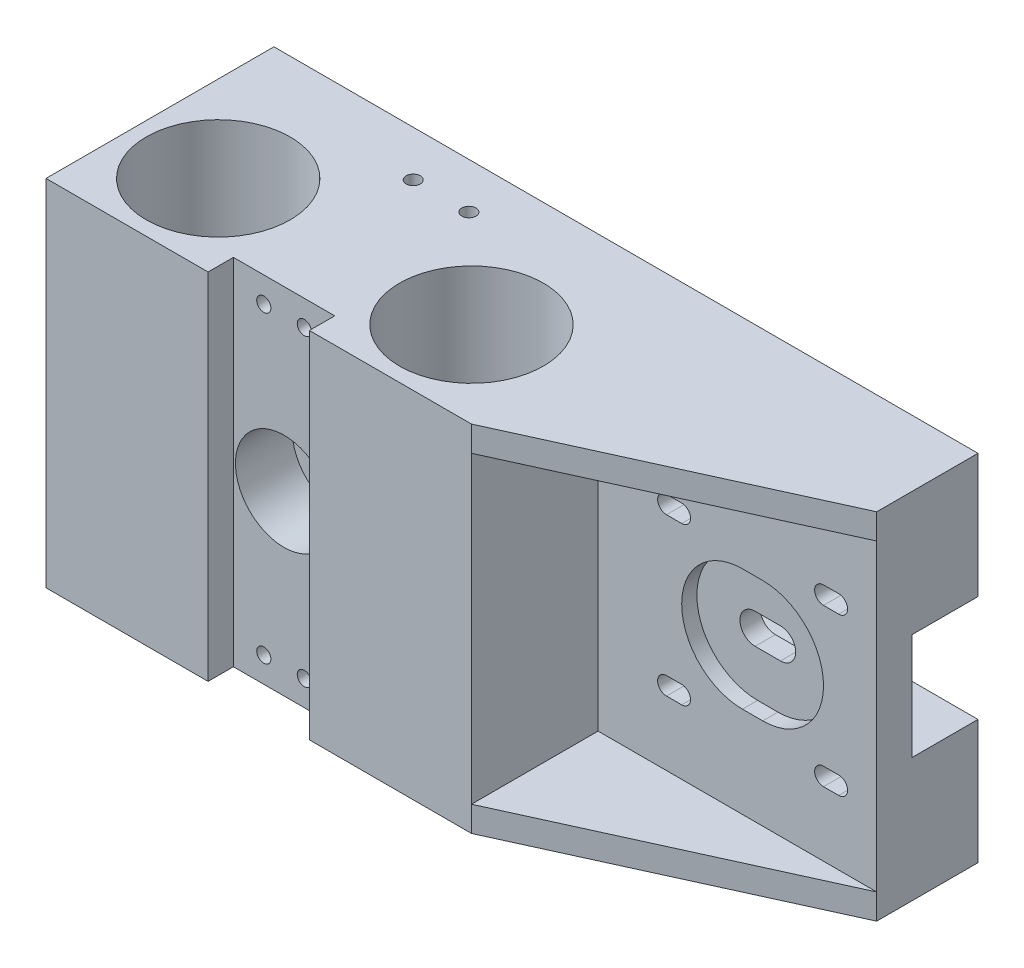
ISO-10303-21;
HEADER;
FILE_DESCRIPTION(('STEP AP214'),'2;1');
FILE_NAME('part.step','',(''),(''),'','','');
FILE_SCHEMA(('AUTOMOTIVE_DESIGN { 1 0 10303 214 1 1 1 1 }'));
ENDSEC;
DATA;
#1=APPLICATION_CONTEXT('core data for automotive mechanical design processes');
#2=APPLICATION_PROTOCOL_DEFINITION('international standard','automotive_design',2000,#1);
#3=PRODUCT_CONTEXT('',#1,'mechanical');
#4=PRODUCT('Part','Part','',(#3));
#5=PRODUCT_RELATED_PRODUCT_CATEGORY('part','',(#4));
#6=PRODUCT_DEFINITION_FORMATION('','',#4);
#7=PRODUCT_DEFINITION_CONTEXT('part definition',#1,'design');
#8=PRODUCT_DEFINITION('design','',#6,#7);
#9=PRODUCT_DEFINITION_SHAPE('','',#8);
#10=(LENGTH_UNIT() NAMED_UNIT(*) SI_UNIT(.MILLI.,.METRE.));
#11=(NAMED_UNIT(*) PLANE_ANGLE_UNIT() SI_UNIT($,.RADIAN.));
#12=(NAMED_UNIT(*) SI_UNIT($,.STERADIAN.) SOLID_ANGLE_UNIT());
#13=UNCERTAINTY_MEASURE_WITH_UNIT(LENGTH_MEASURE(1.E-05),#10,'distance_accuracy_value','');
#14=(GEOMETRIC_REPRESENTATION_CONTEXT(3) GLOBAL_UNCERTAINTY_ASSIGNED_CONTEXT((#13)) GLOBAL_UNIT_ASSIGNED_CONTEXT((#10,
#11,#12)) REPRESENTATION_CONTEXT('',''));
#15=CARTESIAN_POINT('',(0.,0.,0.));
#16=DIRECTION('',(0.,0.,1.));
#17=DIRECTION('',(1.,0.,0.));
#18=AXIS2_PLACEMENT_3D('',#15,#16,#17);
#19=CARTESIAN_POINT('',(89.5000000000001,50.5,28.));
#20=DIRECTION('',(0.,0.,-1.));
#21=DIRECTION('',(-1.,0.,0.));
#22=AXIS2_PLACEMENT_3D('',#19,#20,#21);
#23=CYLINDRICAL_SURFACE('',#22,1.74999999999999);
#24=CARTESIAN_POINT('',(89.5,50.5,-35.));
#25=DIRECTION('',(0.,0.,-1.));
#26=DIRECTION('',(-1.,0.,0.));
#27=AXIS2_PLACEMENT_3D('',#24,#25,#26);
#28=CIRCLE('',#27,1.74999999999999);
#29=CARTESIAN_POINT('',(89.5,48.75,-35.));
#30=VERTEX_POINT('',#29);
#31=CARTESIAN_POINT('',(89.5,52.25,-35.));
#32=VERTEX_POINT('',#31);
#33=EDGE_CURVE('E550',#30,#32,#28,.F.);
#34=ORIENTED_EDGE('',*,*,#33,.F.);
#35=DIRECTION('',(0.,0.,-1.));
#36=VECTOR('',#35,1.);
#37=CARTESIAN_POINT('',(89.5000000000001,48.75,28.));
#38=LINE('',#37,#36);
#39=CARTESIAN_POINT('',(89.5,48.75,-20.));
#40=VERTEX_POINT('',#39);
#41=EDGE_CURVE('E624',#40,#30,#38,.T.);
#42=ORIENTED_EDGE('',*,*,#41,.F.);
#43=CARTESIAN_POINT('',(89.5,50.5,-20.));
#44=DIRECTION('',(0.,0.,-1.));
#45=DIRECTION('',(-1.,0.,0.));
#46=AXIS2_PLACEMENT_3D('',#43,#44,#45);
#47=CIRCLE('',#46,1.74999999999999);
#48=CARTESIAN_POINT('',(89.5,52.25,-20.));
#49=VERTEX_POINT('',#48);
#50=EDGE_CURVE('E665',#49,#40,#47,.T.);
#51=ORIENTED_EDGE('',*,*,#50,.F.);
#52=DIRECTION('',(0.,0.,-1.));
#53=VECTOR('',#52,1.);
#54=CARTESIAN_POINT('',(89.5000000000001,52.25,28.));
#55=LINE('',#54,#53);
#56=EDGE_CURVE('E645',#49,#32,#55,.T.);
#57=ORIENTED_EDGE('',*,*,#56,.T.);
#58=EDGE_LOOP('',(#34,#42,#51,#57));
#59=FACE_BOUND('',#58,.T.);
#60=ADVANCED_FACE('F37',(#59),#23,.F.);
#61=CARTESIAN_POINT('',(89.5000000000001,52.25,28.));
#62=DIRECTION('',(0.,1.,0.));
#63=DIRECTION('',(0.,0.,1.));
#64=AXIS2_PLACEMENT_3D('',#61,#62,#63);
#65=PLANE('',#64);
#66=DIRECTION('',(-1.,0.,0.));
#67=VECTOR('',#66,1.);
#68=CARTESIAN_POINT('',(89.5,52.25,-35.));
#69=LINE('',#68,#67);
#70=CARTESIAN_POINT('',(86.5,52.25,-35.));
#71=VERTEX_POINT('',#70);
#72=EDGE_CURVE('E548',#32,#71,#69,.T.);
#73=ORIENTED_EDGE('',*,*,#72,.F.);
#74=ORIENTED_EDGE('',*,*,#56,.F.);
#75=DIRECTION('',(1.,0.,0.));
#76=VECTOR('',#75,1.);
#77=CARTESIAN_POINT('',(97.,52.25,-20.));
#78=LINE('',#77,#76);
#79=CARTESIAN_POINT('',(86.5,52.25,-20.));
#80=VERTEX_POINT('',#79);
#81=EDGE_CURVE('E662',#80,#49,#78,.T.);
#82=ORIENTED_EDGE('',*,*,#81,.F.);
#83=DIRECTION('',(0.,0.,-1.));
#84=VECTOR('',#83,1.);
#85=CARTESIAN_POINT('',(86.5000000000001,52.25,28.));
#86=LINE('',#85,#84);
#87=EDGE_CURVE('E649',#80,#71,#86,.T.);
#88=ORIENTED_EDGE('',*,*,#87,.T.);
#89=EDGE_LOOP('',(#73,#74,#82,#88));
#90=FACE_BOUND('',#89,.T.);
#91=ADVANCED_FACE('F924',(#90),#65,.F.);
#92=CARTESIAN_POINT('',(86.5,50.5,28.));
#93=DIRECTION('',(0.,0.,-1.));
#94=DIRECTION('',(-1.,0.,0.));
#95=AXIS2_PLACEMENT_3D('',#92,#93,#94);
#96=CYLINDRICAL_SURFACE('',#95,1.74999999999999);
#97=CARTESIAN_POINT('',(86.5,50.5,-35.));
#98=DIRECTION('',(0.,0.,-1.));
#99=DIRECTION('',(-1.,0.,0.));
#100=AXIS2_PLACEMENT_3D('',#97,#98,#99);
#101=CIRCLE('',#100,1.74999999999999);
#102=CARTESIAN_POINT('',(86.5,48.75,-35.));
#103=VERTEX_POINT('',#102);
#104=EDGE_CURVE('E546',#71,#103,#101,.F.);
#105=ORIENTED_EDGE('',*,*,#104,.F.);
#106=ORIENTED_EDGE('',*,*,#87,.F.);
#107=CARTESIAN_POINT('',(86.5,50.5,-20.));
#108=DIRECTION('',(0.,0.,-1.));
#109=DIRECTION('',(-1.,0.,0.));
#110=AXIS2_PLACEMENT_3D('',#107,#108,#109);
#111=CIRCLE('',#110,1.74999999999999);
#112=CARTESIAN_POINT('',(86.5,48.75,-20.));
#113=VERTEX_POINT('',#112);
#114=EDGE_CURVE('E659',#113,#80,#111,.T.);
#115=ORIENTED_EDGE('',*,*,#114,.F.);
#116=DIRECTION('',(0.,0.,-1.));
#117=VECTOR('',#116,1.);
#118=CARTESIAN_POINT('',(86.5,48.75,28.));
#119=LINE('',#118,#117);
#120=EDGE_CURVE('E652',#113,#103,#119,.T.);
#121=ORIENTED_EDGE('',*,*,#120,.T.);
#122=EDGE_LOOP('',(#105,#106,#115,#121));
#123=FACE_BOUND('',#122,.T.);
#124=ADVANCED_FACE('F930',(#123),#96,.F.);
#125=CARTESIAN_POINT('',(89.5000000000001,48.75,28.));
#126=DIRECTION('',(0.,-1.,0.));
#127=DIRECTION('',(0.,0.,-1.));
#128=AXIS2_PLACEMENT_3D('',#125,#126,#127);
#129=PLANE('',#128);
#130=DIRECTION('',(1.,0.,0.));
#131=VECTOR('',#130,1.);
#132=CARTESIAN_POINT('',(89.5,48.75,-35.));
#133=LINE('',#132,#131);
#134=EDGE_CURVE('E11',#103,#30,#133,.T.);
#135=ORIENTED_EDGE('',*,*,#134,.F.);
#136=ORIENTED_EDGE('',*,*,#120,.F.);
#137=DIRECTION('',(-1.,0.,0.));
#138=VECTOR('',#137,1.);
#139=CARTESIAN_POINT('',(97.,48.75,-20.));
#140=LINE('',#139,#138);
#141=EDGE_CURVE('E648',#40,#113,#140,.T.);
#142=ORIENTED_EDGE('',*,*,#141,.F.);
#143=ORIENTED_EDGE('',*,*,#41,.T.);
#144=EDGE_LOOP('',(#135,#136,#142,#143));
#145=FACE_BOUND('',#144,.T.);
#146=ADVANCED_FACE('F936',(#145),#129,.F.);
#147=CARTESIAN_POINT('',(58.5,19.5,28.));
#148=DIRECTION('',(0.,0.,-1.));
#149=DIRECTION('',(-1.,0.,0.));
#150=AXIS2_PLACEMENT_3D('',#147,#148,#149);
#151=CYLINDRICAL_SURFACE('',#150,1.75);
#152=CARTESIAN_POINT('',(58.5,19.5,-35.));
#153=DIRECTION('',(0.,0.,-1.));
#154=DIRECTION('',(-1.,0.,0.));
#155=AXIS2_PLACEMENT_3D('',#152,#153,#154);
#156=CIRCLE('',#155,1.75);
#157=CARTESIAN_POINT('',(58.5,17.75,-35.));
#158=VERTEX_POINT('',#157);
#159=CARTESIAN_POINT('',(58.5,21.25,-35.));
#160=VERTEX_POINT('',#159);
#161=EDGE_CURVE('E544',#158,#160,#156,.F.);
#162=ORIENTED_EDGE('',*,*,#161,.F.);
#163=DIRECTION('',(0.,0.,-1.));
#164=VECTOR('',#163,1.);
#165=CARTESIAN_POINT('',(58.5,17.75,28.));
#166=LINE('',#165,#164);
#167=CARTESIAN_POINT('',(58.5,17.75,-20.));
#168=VERTEX_POINT('',#167);
#169=EDGE_CURVE('E618',#168,#158,#166,.T.);
#170=ORIENTED_EDGE('',*,*,#169,.F.);
#171=CARTESIAN_POINT('',(58.5,19.5,-20.));
#172=DIRECTION('',(0.,0.,-1.));
#173=DIRECTION('',(-1.,0.,0.));
#174=AXIS2_PLACEMENT_3D('',#171,#172,#173);
#175=CIRCLE('',#174,1.75);
#176=CARTESIAN_POINT('',(58.5,21.25,-20.));
#177=VERTEX_POINT('',#176);
#178=EDGE_CURVE('E677',#177,#168,#175,.T.);
#179=ORIENTED_EDGE('',*,*,#178,.F.);
#180=DIRECTION('',(0.,0.,-1.));
#181=VECTOR('',#180,1.);
#182=CARTESIAN_POINT('',(58.5,21.25,28.));
#183=LINE('',#182,#181);
#184=EDGE_CURVE('E608',#177,#160,#183,.T.);
#185=ORIENTED_EDGE('',*,*,#184,.T.);
#186=EDGE_LOOP('',(#162,#170,#179,#185));
#187=FACE_BOUND('',#186,.T.);
#188=ADVANCED_FACE('F902',(#187),#151,.F.);
#189=CARTESIAN_POINT('',(58.5,21.25,28.));
#190=DIRECTION('',(0.,1.,0.));
#191=DIRECTION('',(0.,0.,1.));
#192=AXIS2_PLACEMENT_3D('',#189,#190,#191);
#193=PLANE('',#192);
#194=DIRECTION('',(-1.,0.,0.));
#195=VECTOR('',#194,1.);
#196=CARTESIAN_POINT('',(58.5,21.25,-35.));
#197=LINE('',#196,#195);
#198=CARTESIAN_POINT('',(55.5,21.25,-35.));
#199=VERTEX_POINT('',#198);
#200=EDGE_CURVE('E542',#160,#199,#197,.T.);
#201=ORIENTED_EDGE('',*,*,#200,.F.);
#202=ORIENTED_EDGE('',*,*,#184,.F.);
#203=DIRECTION('',(1.,0.,0.));
#204=VECTOR('',#203,1.);
#205=CARTESIAN_POINT('',(97.,21.25,-20.));
#206=LINE('',#205,#204);
#207=CARTESIAN_POINT('',(55.5,21.25,-20.));
#208=VERTEX_POINT('',#207);
#209=EDGE_CURVE('E674',#208,#177,#206,.T.);
#210=ORIENTED_EDGE('',*,*,#209,.F.);
#211=DIRECTION('',(0.,0.,-1.));
#212=VECTOR('',#211,1.);
#213=CARTESIAN_POINT('',(55.5,21.25,28.));
#214=LINE('',#213,#212);
#215=EDGE_CURVE('E612',#208,#199,#214,.T.);
#216=ORIENTED_EDGE('',*,*,#215,.T.);
#217=EDGE_LOOP('',(#201,#202,#210,#216));
#218=FACE_BOUND('',#217,.T.);
#219=ADVANCED_FACE('F910',(#218),#193,.F.);
#220=CARTESIAN_POINT('',(55.5,19.5,28.));
#221=DIRECTION('',(0.,0.,-1.));
#222=DIRECTION('',(-1.,0.,0.));
#223=AXIS2_PLACEMENT_3D('',#220,#221,#222);
#224=CYLINDRICAL_SURFACE('',#223,1.75);
#225=CARTESIAN_POINT('',(55.5,19.5,-35.));
#226=DIRECTION('',(0.,0.,-1.));
#227=DIRECTION('',(-1.,0.,0.));
#228=AXIS2_PLACEMENT_3D('',#225,#226,#227);
#229=CIRCLE('',#228,1.75);
#230=CARTESIAN_POINT('',(55.5,17.75,-35.));
#231=VERTEX_POINT('',#230);
#232=EDGE_CURVE('E540',#199,#231,#229,.F.);
#233=ORIENTED_EDGE('',*,*,#232,.F.);
#234=ORIENTED_EDGE('',*,*,#215,.F.);
#235=CARTESIAN_POINT('',(55.5,19.5,-20.));
#236=DIRECTION('',(0.,0.,-1.));
#237=DIRECTION('',(-1.,0.,0.));
#238=AXIS2_PLACEMENT_3D('',#235,#236,#237);
#239=CIRCLE('',#238,1.75);
#240=CARTESIAN_POINT('',(55.5,17.75,-20.));
#241=VERTEX_POINT('',#240);
#242=EDGE_CURVE('E671',#241,#208,#239,.T.);
#243=ORIENTED_EDGE('',*,*,#242,.F.);
#244=DIRECTION('',(0.,0.,-1.));
#245=VECTOR('',#244,1.);
#246=CARTESIAN_POINT('',(55.5,17.75,28.));
#247=LINE('',#246,#245);
#248=EDGE_CURVE('E615',#241,#231,#247,.T.);
#249=ORIENTED_EDGE('',*,*,#248,.T.);
#250=EDGE_LOOP('',(#233,#234,#243,#249));
#251=FACE_BOUND('',#250,.T.);
#252=ADVANCED_FACE('F913',(#251),#224,.F.);
#253=CARTESIAN_POINT('',(58.5,17.75,28.));
#254=DIRECTION('',(0.,-1.,0.));
#255=DIRECTION('',(0.,0.,-1.));
#256=AXIS2_PLACEMENT_3D('',#253,#254,#255);
#257=PLANE('',#256);
#258=DIRECTION('',(1.,0.,0.));
#259=VECTOR('',#258,1.);
#260=CARTESIAN_POINT('',(58.5,17.75,-35.));
#261=LINE('',#260,#259);
#262=EDGE_CURVE('E45',#231,#158,#261,.T.);
#263=ORIENTED_EDGE('',*,*,#262,.F.);
#264=ORIENTED_EDGE('',*,*,#248,.F.);
#265=DIRECTION('',(-1.,0.,0.));
#266=VECTOR('',#265,1.);
#267=CARTESIAN_POINT('',(97.,17.75,-20.));
#268=LINE('',#267,#266);
#269=EDGE_CURVE('E668',#168,#241,#268,.T.);
#270=ORIENTED_EDGE('',*,*,#269,.F.);
#271=ORIENTED_EDGE('',*,*,#169,.T.);
#272=EDGE_LOOP('',(#263,#264,#270,#271));
#273=FACE_BOUND('',#272,.T.);
#274=ADVANCED_FACE('F904',(#273),#257,.F.);
#275=CARTESIAN_POINT('',(89.5,19.4999999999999,28.));
#276=DIRECTION('',(0.,0.,-1.));
#277=DIRECTION('',(-1.,0.,0.));
#278=AXIS2_PLACEMENT_3D('',#275,#276,#277);
#279=CYLINDRICAL_SURFACE('',#278,1.75);
#280=CARTESIAN_POINT('',(89.5,19.4999999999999,-35.));
#281=DIRECTION('',(0.,0.,-1.));
#282=DIRECTION('',(-1.,0.,0.));
#283=AXIS2_PLACEMENT_3D('',#280,#281,#282);
#284=CIRCLE('',#283,1.75);
#285=CARTESIAN_POINT('',(89.5,17.7499999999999,-35.));
#286=VERTEX_POINT('',#285);
#287=CARTESIAN_POINT('',(89.5,21.2499999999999,-35.));
#288=VERTEX_POINT('',#287);
#289=EDGE_CURVE('E538',#286,#288,#284,.F.);
#290=ORIENTED_EDGE('',*,*,#289,.F.);
#291=DIRECTION('',(0.,0.,-1.));
#292=VECTOR('',#291,1.);
#293=CARTESIAN_POINT('',(89.5,17.7499999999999,28.));
#294=LINE('',#293,#292);
#295=CARTESIAN_POINT('',(89.5,17.7499999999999,-20.));
#296=VERTEX_POINT('',#295);
#297=EDGE_CURVE('E611',#296,#286,#294,.T.);
#298=ORIENTED_EDGE('',*,*,#297,.F.);
#299=CARTESIAN_POINT('',(89.5,19.4999999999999,-20.));
#300=DIRECTION('',(0.,0.,-1.));
#301=DIRECTION('',(-1.,0.,0.));
#302=AXIS2_PLACEMENT_3D('',#299,#300,#301);
#303=CIRCLE('',#302,1.75);
#304=CARTESIAN_POINT('',(89.5,21.2499999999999,-20.));
#305=VERTEX_POINT('',#304);
#306=EDGE_CURVE('E689',#305,#296,#303,.T.);
#307=ORIENTED_EDGE('',*,*,#306,.F.);
#308=DIRECTION('',(0.,0.,-1.));
#309=VECTOR('',#308,1.);
#310=CARTESIAN_POINT('',(89.5,21.2499999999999,28.));
#311=LINE('',#310,#309);
#312=EDGE_CURVE('E634',#305,#288,#311,.T.);
#313=ORIENTED_EDGE('',*,*,#312,.T.);
#314=EDGE_LOOP('',(#290,#298,#307,#313));
#315=FACE_BOUND('',#314,.T.);
#316=ADVANCED_FACE('F920',(#315),#279,.F.);
#317=CARTESIAN_POINT('',(89.5,21.2499999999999,28.));
#318=DIRECTION('',(0.,1.,0.));
#319=DIRECTION('',(0.,0.,1.));
#320=AXIS2_PLACEMENT_3D('',#317,#318,#319);
#321=PLANE('',#320);
#322=DIRECTION('',(-1.,0.,0.));
#323=VECTOR('',#322,1.);
#324=CARTESIAN_POINT('',(89.5,21.2499999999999,-35.));
#325=LINE('',#324,#323);
#326=CARTESIAN_POINT('',(86.5,21.2499999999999,-35.));
#327=VERTEX_POINT('',#326);
#328=EDGE_CURVE('E536',#288,#327,#325,.T.);
#329=ORIENTED_EDGE('',*,*,#328,.F.);
#330=ORIENTED_EDGE('',*,*,#312,.F.);
#331=DIRECTION('',(1.,0.,0.));
#332=VECTOR('',#331,1.);
#333=CARTESIAN_POINT('',(97.,21.25,-20.));
#334=LINE('',#333,#332);
#335=CARTESIAN_POINT('',(86.5,21.2499999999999,-20.));
#336=VERTEX_POINT('',#335);
#337=EDGE_CURVE('E686',#336,#305,#334,.T.);
#338=ORIENTED_EDGE('',*,*,#337,.F.);
#339=DIRECTION('',(0.,0.,-1.));
#340=VECTOR('',#339,1.);
#341=CARTESIAN_POINT('',(86.5,21.2499999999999,28.));
#342=LINE('',#341,#340);
#343=EDGE_CURVE('E637',#336,#327,#342,.T.);
#344=ORIENTED_EDGE('',*,*,#343,.T.);
#345=EDGE_LOOP('',(#329,#330,#338,#344));
#346=FACE_BOUND('',#345,.T.);
#347=ADVANCED_FACE('F1204',(#346),#321,.F.);
#348=CARTESIAN_POINT('',(86.5,19.4999999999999,28.));
#349=DIRECTION('',(0.,0.,-1.));
#350=DIRECTION('',(-1.,0.,0.));
#351=AXIS2_PLACEMENT_3D('',#348,#349,#350);
#352=CYLINDRICAL_SURFACE('',#351,1.75);
#353=CARTESIAN_POINT('',(86.5,19.4999999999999,-35.));
#354=DIRECTION('',(0.,0.,-1.));
#355=DIRECTION('',(-1.,0.,0.));
#356=AXIS2_PLACEMENT_3D('',#353,#354,#355);
#357=CIRCLE('',#356,1.75);
#358=CARTESIAN_POINT('',(86.5,17.7499999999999,-35.));
#359=VERTEX_POINT('',#358);
#360=EDGE_CURVE('E534',#327,#359,#357,.F.);
#361=ORIENTED_EDGE('',*,*,#360,.F.);
#362=ORIENTED_EDGE('',*,*,#343,.F.);
#363=CARTESIAN_POINT('',(86.5,19.4999999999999,-20.));
#364=DIRECTION('',(0.,0.,-1.));
#365=DIRECTION('',(-1.,0.,0.));
#366=AXIS2_PLACEMENT_3D('',#363,#364,#365);
#367=CIRCLE('',#366,1.75);
#368=CARTESIAN_POINT('',(86.5,17.7499999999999,-20.));
#369=VERTEX_POINT('',#368);
#370=EDGE_CURVE('E683',#369,#336,#367,.T.);
#371=ORIENTED_EDGE('',*,*,#370,.F.);
#372=DIRECTION('',(0.,0.,-1.));
#373=VECTOR('',#372,1.);
#374=CARTESIAN_POINT('',(86.5,17.7499999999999,28.));
#375=LINE('',#374,#373);
#376=EDGE_CURVE('E640',#369,#359,#375,.T.);
#377=ORIENTED_EDGE('',*,*,#376,.T.);
#378=EDGE_LOOP('',(#361,#362,#371,#377));
#379=FACE_BOUND('',#378,.T.);
#380=ADVANCED_FACE('F1196',(#379),#352,.F.);
#381=CARTESIAN_POINT('',(89.5,17.7499999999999,28.));
#382=DIRECTION('',(0.,-1.,0.));
#383=DIRECTION('',(0.,0.,-1.));
#384=AXIS2_PLACEMENT_3D('',#381,#382,#383);
#385=PLANE('',#384);
#386=DIRECTION('',(1.,0.,0.));
#387=VECTOR('',#386,1.);
#388=CARTESIAN_POINT('',(89.5,17.7499999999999,-35.));
#389=LINE('',#388,#387);
#390=EDGE_CURVE('E894',#359,#286,#389,.T.);
#391=ORIENTED_EDGE('',*,*,#390,.F.);
#392=ORIENTED_EDGE('',*,*,#376,.F.);
#393=DIRECTION('',(-1.,0.,0.));
#394=VECTOR('',#393,1.);
#395=CARTESIAN_POINT('',(97.,17.7499999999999,-20.));
#396=LINE('',#395,#394);
#397=EDGE_CURVE('E680',#296,#369,#396,.T.);
#398=ORIENTED_EDGE('',*,*,#397,.F.);
#399=ORIENTED_EDGE('',*,*,#297,.T.);
#400=EDGE_LOOP('',(#391,#392,#398,#399));
#401=FACE_BOUND('',#400,.T.);
#402=ADVANCED_FACE('F1188',(#401),#385,.F.);
#403=CARTESIAN_POINT('',(58.5,50.5,28.));
#404=DIRECTION('',(0.,0.,-1.));
#405=DIRECTION('',(-1.,0.,0.));
#406=AXIS2_PLACEMENT_3D('',#403,#404,#405);
#407=CYLINDRICAL_SURFACE('',#406,1.75);
#408=CARTESIAN_POINT('',(58.5,50.5,-35.));
#409=DIRECTION('',(0.,0.,-1.));
#410=DIRECTION('',(-1.,0.,0.));
#411=AXIS2_PLACEMENT_3D('',#408,#409,#410);
#412=CIRCLE('',#411,1.75);
#413=CARTESIAN_POINT('',(58.5,48.75,-35.));
#414=VERTEX_POINT('',#413);
#415=CARTESIAN_POINT('',(58.5,52.25,-35.));
#416=VERTEX_POINT('',#415);
#417=EDGE_CURVE('E532',#414,#416,#412,.F.);
#418=ORIENTED_EDGE('',*,*,#417,.F.);
#419=DIRECTION('',(0.,0.,-1.));
#420=VECTOR('',#419,1.);
#421=CARTESIAN_POINT('',(58.5,48.75,28.));
#422=LINE('',#421,#420);
#423=CARTESIAN_POINT('',(58.5,48.75,-20.));
#424=VERTEX_POINT('',#423);
#425=EDGE_CURVE('E631',#424,#414,#422,.T.);
#426=ORIENTED_EDGE('',*,*,#425,.F.);
#427=CARTESIAN_POINT('',(58.5,50.5,-20.));
#428=DIRECTION('',(0.,0.,-1.));
#429=DIRECTION('',(-1.,0.,0.));
#430=AXIS2_PLACEMENT_3D('',#427,#428,#429);
#431=CIRCLE('',#430,1.75);
#432=CARTESIAN_POINT('',(58.5,52.25,-20.));
#433=VERTEX_POINT('',#432);
#434=EDGE_CURVE('E701',#433,#424,#431,.T.);
#435=ORIENTED_EDGE('',*,*,#434,.F.);
#436=DIRECTION('',(0.,0.,-1.));
#437=VECTOR('',#436,1.);
#438=CARTESIAN_POINT('',(58.5,52.25,28.));
#439=LINE('',#438,#437);
#440=EDGE_CURVE('E621',#433,#416,#439,.T.);
#441=ORIENTED_EDGE('',*,*,#440,.T.);
#442=EDGE_LOOP('',(#418,#426,#435,#441));
#443=FACE_BOUND('',#442,.T.);
#444=ADVANCED_FACE('F1180',(#443),#407,.F.);
#445=CARTESIAN_POINT('',(58.5,52.25,28.));
#446=DIRECTION('',(0.,1.,0.));
#447=DIRECTION('',(-1.,0.,0.));
#448=AXIS2_PLACEMENT_3D('',#445,#446,#447);
#449=PLANE('',#448);
#450=DIRECTION('',(-1.,0.,0.));
#451=VECTOR('',#450,1.);
#452=CARTESIAN_POINT('',(58.5,52.25,-35.));
#453=LINE('',#452,#451);
#454=CARTESIAN_POINT('',(55.5,52.25,-35.));
#455=VERTEX_POINT('',#454);
#456=EDGE_CURVE('E530',#416,#455,#453,.T.);
#457=ORIENTED_EDGE('',*,*,#456,.F.);
#458=ORIENTED_EDGE('',*,*,#440,.F.);
#459=DIRECTION('',(1.,0.,0.));
#460=VECTOR('',#459,1.);
#461=CARTESIAN_POINT('',(97.,52.2499999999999,-20.));
#462=LINE('',#461,#460);
#463=CARTESIAN_POINT('',(55.5,52.25,-20.));
#464=VERTEX_POINT('',#463);
#465=EDGE_CURVE('E698',#464,#433,#462,.T.);
#466=ORIENTED_EDGE('',*,*,#465,.F.);
#467=DIRECTION('',(0.,0.,-1.));
#468=VECTOR('',#467,1.);
#469=CARTESIAN_POINT('',(55.5,52.25,28.));
#470=LINE('',#469,#468);
#471=EDGE_CURVE('E625',#464,#455,#470,.T.);
#472=ORIENTED_EDGE('',*,*,#471,.T.);
#473=EDGE_LOOP('',(#457,#458,#466,#472));
#474=FACE_BOUND('',#473,.T.);
#475=ADVANCED_FACE('F1172',(#474),#449,.F.);
#476=CARTESIAN_POINT('',(55.5,50.5,28.));
#477=DIRECTION('',(0.,0.,-1.));
#478=DIRECTION('',(-1.,0.,0.));
#479=AXIS2_PLACEMENT_3D('',#476,#477,#478);
#480=CYLINDRICAL_SURFACE('',#479,1.75000000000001);
#481=CARTESIAN_POINT('',(55.5,50.5,-35.));
#482=DIRECTION('',(0.,0.,-1.));
#483=DIRECTION('',(-1.,0.,0.));
#484=AXIS2_PLACEMENT_3D('',#481,#482,#483);
#485=CIRCLE('',#484,1.75000000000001);
#486=CARTESIAN_POINT('',(55.5,48.75,-35.));
#487=VERTEX_POINT('',#486);
#488=EDGE_CURVE('E522',#455,#487,#485,.F.);
#489=ORIENTED_EDGE('',*,*,#488,.F.);
#490=ORIENTED_EDGE('',*,*,#471,.F.);
#491=CARTESIAN_POINT('',(55.5,50.5,-20.));
#492=DIRECTION('',(0.,0.,-1.));
#493=DIRECTION('',(-1.,0.,0.));
#494=AXIS2_PLACEMENT_3D('',#491,#492,#493);
#495=CIRCLE('',#494,1.75000000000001);
#496=CARTESIAN_POINT('',(55.5,48.75,-20.));
#497=VERTEX_POINT('',#496);
#498=EDGE_CURVE('E695',#497,#464,#495,.T.);
#499=ORIENTED_EDGE('',*,*,#498,.F.);
#500=DIRECTION('',(0.,0.,-1.));
#501=VECTOR('',#500,1.);
#502=CARTESIAN_POINT('',(55.5,48.75,28.));
#503=LINE('',#502,#501);
#504=EDGE_CURVE('E628',#497,#487,#503,.T.);
#505=ORIENTED_EDGE('',*,*,#504,.T.);
#506=EDGE_LOOP('',(#489,#490,#499,#505));
#507=FACE_BOUND('',#506,.T.);
#508=ADVANCED_FACE('F1163',(#507),#480,.F.);
#509=CARTESIAN_POINT('',(58.5,48.75,28.));
#510=DIRECTION('',(0.,-1.,0.));
#511=DIRECTION('',(0.,0.,-1.));
#512=AXIS2_PLACEMENT_3D('',#509,#510,#511);
#513=PLANE('',#512);
#514=DIRECTION('',(1.,0.,0.));
#515=VECTOR('',#514,1.);
#516=CARTESIAN_POINT('',(58.5,48.75,-35.));
#517=LINE('',#516,#515);
#518=EDGE_CURVE('E892',#487,#414,#517,.T.);
#519=ORIENTED_EDGE('',*,*,#518,.F.);
#520=ORIENTED_EDGE('',*,*,#504,.F.);
#521=DIRECTION('',(-1.,0.,0.));
#522=VECTOR('',#521,1.);
#523=CARTESIAN_POINT('',(97.,48.75,-20.));
#524=LINE('',#523,#522);
#525=EDGE_CURVE('E692',#424,#497,#524,.T.);
#526=ORIENTED_EDGE('',*,*,#525,.F.);
#527=ORIENTED_EDGE('',*,*,#425,.T.);
#528=EDGE_LOOP('',(#519,#520,#526,#527));
#529=FACE_BOUND('',#528,.T.);
#530=ADVANCED_FACE('F1058',(#529),#513,.F.);
#531=CARTESIAN_POINT('',(42.,70.,0.));
#532=DIRECTION('',(-1.,0.,0.));
#533=DIRECTION('',(0.,0.,1.));
#534=AXIS2_PLACEMENT_3D('',#531,#532,#533);
#535=PLANE('',#534);
#536=DIRECTION('',(0.,0.,-1.));
#537=VECTOR('',#536,1.);
#538=CARTESIAN_POINT('',(42.,5.,-20.));
#539=LINE('',#538,#537);
#540=CARTESIAN_POINT('',(42.,5.,5.));
#541=VERTEX_POINT('',#540);
#542=CARTESIAN_POINT('',(42.,5.,-20.));
#543=VERTEX_POINT('',#542);
#544=EDGE_CURVE('E705',#541,#543,#539,.T.);
#545=ORIENTED_EDGE('',*,*,#544,.T.);
#546=DIRECTION('',(0.,-1.,0.));
#547=VECTOR('',#546,1.);
#548=CARTESIAN_POINT('',(42.,70.,-20.));
#549=LINE('',#548,#547);
#550=CARTESIAN_POINT('',(42.,65.,-20.));
#551=VERTEX_POINT('',#550);
#552=EDGE_CURVE('E764',#551,#543,#549,.T.);
#553=ORIENTED_EDGE('',*,*,#552,.F.);
#554=DIRECTION('',(0.,0.,1.));
#555=VECTOR('',#554,1.);
#556=CARTESIAN_POINT('',(42.,65.,-20.));
#557=LINE('',#556,#555);
#558=CARTESIAN_POINT('',(42.,65.,5.));
#559=VERTEX_POINT('',#558);
#560=EDGE_CURVE('E722',#551,#559,#557,.T.);
#561=ORIENTED_EDGE('',*,*,#560,.T.);
#562=DIRECTION('',(0.,-1.,0.));
#563=VECTOR('',#562,1.);
#564=CARTESIAN_POINT('',(42.,70.,5.));
#565=LINE('',#564,#563);
#566=EDGE_CURVE('E871',#559,#541,#565,.T.);
#567=ORIENTED_EDGE('',*,*,#566,.T.);
#568=EDGE_LOOP('',(#545,#553,#561,#567));
#569=FACE_BOUND('',#568,.T.);
#570=ADVANCED_FACE('F980',(#569),#535,.F.);
#571=CARTESIAN_POINT('',(97.,70.,-20.));
#572=DIRECTION('',(0.,0.,-1.));
#573=DIRECTION('',(-1.,0.,0.));
#574=AXIS2_PLACEMENT_3D('',#571,#572,#573);
#575=PLANE('',#574);
#576=DIRECTION('',(1.,0.,0.));
#577=VECTOR('',#576,1.);
#578=CARTESIAN_POINT('',(70.5000000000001,22.9999999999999,-20.));
#579=LINE('',#578,#577);
#580=CARTESIAN_POINT('',(70.5000000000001,22.9999999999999,-20.));
#581=VERTEX_POINT('',#580);
#582=CARTESIAN_POINT('',(74.5,22.9999999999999,-20.));
#583=VERTEX_POINT('',#582);
#584=EDGE_CURVE('E588',#581,#583,#579,.T.);
#585=ORIENTED_EDGE('',*,*,#584,.F.);
#586=CARTESIAN_POINT('',(70.5,35.,-20.));
#587=DIRECTION('',(0.,0.,1.));
#588=DIRECTION('',(1.,0.,0.));
#589=AXIS2_PLACEMENT_3D('',#586,#587,#588);
#590=CIRCLE('',#589,12.);
#591=CARTESIAN_POINT('',(70.5,47.,-20.));
#592=VERTEX_POINT('',#591);
#593=EDGE_CURVE('E566',#592,#581,#590,.T.);
#594=ORIENTED_EDGE('',*,*,#593,.F.);
#595=DIRECTION('',(-1.,0.,0.));
#596=VECTOR('',#595,1.);
#597=CARTESIAN_POINT('',(70.5,47.,-20.));
#598=LINE('',#597,#596);
#599=CARTESIAN_POINT('',(74.5,47.,-20.));
#600=VERTEX_POINT('',#599);
#601=EDGE_CURVE('E577',#600,#592,#598,.T.);
#602=ORIENTED_EDGE('',*,*,#601,.F.);
#603=CARTESIAN_POINT('',(74.5000000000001,35.,-20.));
#604=DIRECTION('',(0.,0.,1.));
#605=DIRECTION('',(1.,0.,0.));
#606=AXIS2_PLACEMENT_3D('',#603,#604,#605);
#607=CIRCLE('',#606,12.);
#608=EDGE_CURVE('E591',#583,#600,#607,.T.);
#609=ORIENTED_EDGE('',*,*,#608,.F.);
#610=EDGE_LOOP('',(#585,#594,#602,#609));
#611=FACE_BOUND('',#610,.T.);
#612=ORIENTED_EDGE('',*,*,#465,.T.);
#613=ORIENTED_EDGE('',*,*,#434,.T.);
#614=ORIENTED_EDGE('',*,*,#525,.T.);
#615=ORIENTED_EDGE('',*,*,#498,.T.);
#616=EDGE_LOOP('',(#612,#613,#614,#615));
#617=FACE_BOUND('',#616,.T.);
#618=ORIENTED_EDGE('',*,*,#337,.T.);
#619=ORIENTED_EDGE('',*,*,#306,.T.);
#620=ORIENTED_EDGE('',*,*,#397,.T.);
#621=ORIENTED_EDGE('',*,*,#370,.T.);
#622=EDGE_LOOP('',(#618,#619,#620,#621));
#623=FACE_BOUND('',#622,.T.);
#624=ORIENTED_EDGE('',*,*,#209,.T.);
#625=ORIENTED_EDGE('',*,*,#178,.T.);
#626=ORIENTED_EDGE('',*,*,#269,.T.);
#627=ORIENTED_EDGE('',*,*,#242,.T.);
#628=EDGE_LOOP('',(#624,#625,#626,#627));
#629=FACE_BOUND('',#628,.T.);
#630=ORIENTED_EDGE('',*,*,#81,.T.);
#631=ORIENTED_EDGE('',*,*,#50,.T.);
#632=ORIENTED_EDGE('',*,*,#141,.T.);
#633=ORIENTED_EDGE('',*,*,#114,.T.);
#634=EDGE_LOOP('',(#630,#631,#632,#633));
#635=FACE_BOUND('',#634,.T.);
#636=DIRECTION('',(1.,0.,0.));
#637=VECTOR('',#636,1.);
#638=CARTESIAN_POINT('',(97.,5.,-20.));
#639=LINE('',#638,#637);
#640=CARTESIAN_POINT('',(97.,5.,-20.));
#641=VERTEX_POINT('',#640);
#642=EDGE_CURVE('E708',#543,#641,#639,.T.);
#643=ORIENTED_EDGE('',*,*,#642,.T.);
#644=DIRECTION('',(0.,-1.,0.));
#645=VECTOR('',#644,1.);
#646=CARTESIAN_POINT('',(97.,70.,-20.));
#647=LINE('',#646,#645);
#648=CARTESIAN_POINT('',(97.,65.,-20.));
#649=VERTEX_POINT('',#648);
#650=EDGE_CURVE('E772',#649,#641,#647,.T.);
#651=ORIENTED_EDGE('',*,*,#650,.F.);
#652=DIRECTION('',(-1.,0.,0.));
#653=VECTOR('',#652,1.);
#654=CARTESIAN_POINT('',(97.,65.,-20.));
#655=LINE('',#654,#653);
#656=EDGE_CURVE('E728',#649,#551,#655,.T.);
#657=ORIENTED_EDGE('',*,*,#656,.T.);
#658=ORIENTED_EDGE('',*,*,#552,.T.);
#659=EDGE_LOOP('',(#643,#651,#657,#658));
#660=FACE_BOUND('',#659,.T.);
#661=ADVANCED_FACE('F907',(#611,#617,#623,#629,#635,#660),#575,.F.);
#662=CARTESIAN_POINT('',(-10.,70.,0.));
#663=DIRECTION('',(1.,0.,0.));
#664=DIRECTION('',(0.,0.,-1.));
#665=AXIS2_PLACEMENT_3D('',#662,#663,#664);
#666=PLANE('',#665);
#667=DIRECTION('',(0.,0.,1.));
#668=VECTOR('',#667,1.);
#669=CARTESIAN_POINT('',(-10.,0.,0.));
#670=LINE('',#669,#668);
#671=CARTESIAN_POINT('',(-10.,0.,0.));
#672=VERTEX_POINT('',#671);
#673=CARTESIAN_POINT('',(-10.,0.,5.));
#674=VERTEX_POINT('',#673);
#675=EDGE_CURVE('E812',#672,#674,#670,.T.);
#676=ORIENTED_EDGE('',*,*,#675,.F.);
#677=DIRECTION('',(0.,-1.,0.));
#678=VECTOR('',#677,1.);
#679=CARTESIAN_POINT('',(-10.,70.,0.));
#680=LINE('',#679,#678);
#681=CARTESIAN_POINT('',(-10.,70.,0.));
#682=VERTEX_POINT('',#681);
#683=EDGE_CURVE('E879',#682,#672,#680,.T.);
#684=ORIENTED_EDGE('',*,*,#683,.F.);
#685=DIRECTION('',(0.,0.,1.));
#686=VECTOR('',#685,1.);
#687=CARTESIAN_POINT('',(-10.,70.,0.));
#688=LINE('',#687,#686);
#689=CARTESIAN_POINT('',(-10.,70.,5.));
#690=VERTEX_POINT('',#689);
#691=EDGE_CURVE('E815',#682,#690,#688,.T.);
#692=ORIENTED_EDGE('',*,*,#691,.T.);
#693=DIRECTION('',(0.,-1.,0.));
#694=VECTOR('',#693,1.);
#695=CARTESIAN_POINT('',(-10.,70.,5.));
#696=LINE('',#695,#694);
#697=EDGE_CURVE('E841',#690,#674,#696,.T.);
#698=ORIENTED_EDGE('',*,*,#697,.T.);
#699=EDGE_LOOP('',(#676,#684,#692,#698));
#700=FACE_BOUND('',#699,.T.);
#701=ADVANCED_FACE('F39',(#700),#666,.T.);
#702=CARTESIAN_POINT('',(0.,70.,0.));
#703=DIRECTION('',(0.,0.,1.));
#704=DIRECTION('',(1.,0.,0.));
#705=AXIS2_PLACEMENT_3D('',#702,#703,#704);
#706=PLANE('',#705);
#707=CARTESIAN_POINT('',(0.,35.,0.));
#708=DIRECTION('',(0.,0.,1.));
#709=DIRECTION('',(1.,0.,0.));
#710=AXIS2_PLACEMENT_3D('',#707,#708,#709);
#711=CIRCLE('',#710,9.6);
#712=CARTESIAN_POINT('',(9.6,35.,0.));
#713=VERTEX_POINT('',#712);
#714=EDGE_CURVE('E784',#713,#713,#711,.T.);
#715=ORIENTED_EDGE('',*,*,#714,.F.);
#716=EDGE_LOOP('',(#715));
#717=FACE_BOUND('',#716,.T.);
#718=CARTESIAN_POINT('',(4.,65.,0.));
#719=DIRECTION('',(0.,0.,1.));
#720=DIRECTION('',(-1.,0.,0.));
#721=AXIS2_PLACEMENT_3D('',#718,#719,#720);
#722=CIRCLE('',#721,1.4);
#723=CARTESIAN_POINT('',(2.6,65.,0.));
#724=VERTEX_POINT('',#723);
#725=EDGE_CURVE('E788',#724,#724,#722,.T.);
#726=ORIENTED_EDGE('',*,*,#725,.F.);
#727=EDGE_LOOP('',(#726));
#728=FACE_BOUND('',#727,.T.);
#729=CARTESIAN_POINT('',(4.,5.,0.));
#730=DIRECTION('',(0.,0.,1.));
#731=DIRECTION('',(1.,0.,0.));
#732=AXIS2_PLACEMENT_3D('',#729,#730,#731);
#733=CIRCLE('',#732,1.4);
#734=CARTESIAN_POINT('',(5.4,5.,0.));
#735=VERTEX_POINT('',#734);
#736=EDGE_CURVE('E801',#735,#735,#733,.T.);
#737=ORIENTED_EDGE('',*,*,#736,.F.);
#738=EDGE_LOOP('',(#737));
#739=FACE_BOUND('',#738,.T.);
#740=CARTESIAN_POINT('',(-4.,5.,0.));
#741=DIRECTION('',(0.,0.,1.));
#742=DIRECTION('',(-1.,0.,0.));
#743=AXIS2_PLACEMENT_3D('',#740,#741,#742);
#744=CIRCLE('',#743,1.4);
#745=CARTESIAN_POINT('',(-5.4,5.,0.));
#746=VERTEX_POINT('',#745);
#747=EDGE_CURVE('E795',#746,#746,#744,.T.);
#748=ORIENTED_EDGE('',*,*,#747,.F.);
#749=EDGE_LOOP('',(#748));
#750=FACE_BOUND('',#749,.T.);
#751=CARTESIAN_POINT('',(-4.,65.,0.));
#752=DIRECTION('',(0.,0.,1.));
#753=DIRECTION('',(1.,0.,0.));
#754=AXIS2_PLACEMENT_3D('',#751,#752,#753);
#755=CIRCLE('',#754,1.4);
#756=CARTESIAN_POINT('',(-2.6,65.,0.));
#757=VERTEX_POINT('',#756);
#758=EDGE_CURVE('E794',#757,#757,#755,.T.);
#759=ORIENTED_EDGE('',*,*,#758,.F.);
#760=EDGE_LOOP('',(#759));
#761=FACE_BOUND('',#760,.T.);
#762=DIRECTION('',(-1.,0.,0.));
#763=VECTOR('',#762,1.);
#764=CARTESIAN_POINT('',(0.,0.,0.));
#765=LINE('',#764,#763);
#766=CARTESIAN_POINT('',(10.,0.,0.));
#767=VERTEX_POINT('',#766);
#768=EDGE_CURVE('E844',#767,#672,#765,.T.);
#769=ORIENTED_EDGE('',*,*,#768,.F.);
#770=DIRECTION('',(0.,-1.,0.));
#771=VECTOR('',#770,1.);
#772=CARTESIAN_POINT('',(10.,70.,0.));
#773=LINE('',#772,#771);
#774=CARTESIAN_POINT('',(10.,70.,0.));
#775=VERTEX_POINT('',#774);
#776=EDGE_CURVE('E877',#775,#767,#773,.T.);
#777=ORIENTED_EDGE('',*,*,#776,.F.);
#778=DIRECTION('',(-1.,0.,0.));
#779=VECTOR('',#778,1.);
#780=CARTESIAN_POINT('',(0.,70.,0.));
#781=LINE('',#780,#779);
#782=EDGE_CURVE('E818',#775,#682,#781,.T.);
#783=ORIENTED_EDGE('',*,*,#782,.T.);
#784=ORIENTED_EDGE('',*,*,#683,.T.);
#785=EDGE_LOOP('',(#769,#777,#783,#784));
#786=FACE_BOUND('',#785,.T.);
#787=ADVANCED_FACE('F1065',(#717,#728,#739,#750,#761,#786),#706,.T.);
#788=CARTESIAN_POINT('',(10.,70.,0.));
#789=DIRECTION('',(1.,0.,0.));
#790=DIRECTION('',(0.,0.,-1.));
#791=AXIS2_PLACEMENT_3D('',#788,#789,#790);
#792=PLANE('',#791);
#793=DIRECTION('',(0.,0.,1.));
#794=VECTOR('',#793,1.);
#795=CARTESIAN_POINT('',(10.,0.,0.));
#796=LINE('',#795,#794);
#797=CARTESIAN_POINT('',(10.,0.,5.));
#798=VERTEX_POINT('',#797);
#799=EDGE_CURVE('E847',#767,#798,#796,.T.);
#800=ORIENTED_EDGE('',*,*,#799,.T.);
#801=DIRECTION('',(0.,-1.,0.));
#802=VECTOR('',#801,1.);
#803=CARTESIAN_POINT('',(10.,70.,5.));
#804=LINE('',#803,#802);
#805=CARTESIAN_POINT('',(10.,70.,5.));
#806=VERTEX_POINT('',#805);
#807=EDGE_CURVE('E874',#806,#798,#804,.T.);
#808=ORIENTED_EDGE('',*,*,#807,.F.);
#809=DIRECTION('',(0.,0.,1.));
#810=VECTOR('',#809,1.);
#811=CARTESIAN_POINT('',(10.,70.,0.));
#812=LINE('',#811,#810);
#813=EDGE_CURVE('E822',#775,#806,#812,.T.);
#814=ORIENTED_EDGE('',*,*,#813,.F.);
#815=ORIENTED_EDGE('',*,*,#776,.T.);
#816=EDGE_LOOP('',(#800,#808,#814,#815));
#817=FACE_BOUND('',#816,.T.);
#818=ADVANCED_FACE('F1062',(#817),#792,.F.);
#819=CARTESIAN_POINT('',(0.,70.,5.));
#820=DIRECTION('',(0.,0.,-1.));
#821=DIRECTION('',(-1.,0.,0.));
#822=AXIS2_PLACEMENT_3D('',#819,#820,#821);
#823=PLANE('',#822);
#824=DIRECTION('',(1.,0.,0.));
#825=VECTOR('',#824,1.);
#826=CARTESIAN_POINT('',(0.,0.,5.));
#827=LINE('',#826,#825);
#828=CARTESIAN_POINT('',(42.,0.,5.));
#829=VERTEX_POINT('',#828);
#830=EDGE_CURVE('E849',#798,#829,#827,.T.);
#831=ORIENTED_EDGE('',*,*,#830,.T.);
#832=DIRECTION('',(0.,-1.,0.));
#833=VECTOR('',#832,1.);
#834=CARTESIAN_POINT('',(42.,5.,5.));
#835=LINE('',#834,#833);
#836=EDGE_CURVE('E717',#541,#829,#835,.T.);
#837=ORIENTED_EDGE('',*,*,#836,.F.);
#838=ORIENTED_EDGE('',*,*,#566,.F.);
#839=CARTESIAN_POINT('',(42.,70.,5.));
#840=VERTEX_POINT('',#839);
#841=EDGE_CURVE('E872',#840,#559,#565,.T.);
#842=ORIENTED_EDGE('',*,*,#841,.F.);
#843=DIRECTION('',(1.,0.,0.));
#844=VECTOR('',#843,1.);
#845=CARTESIAN_POINT('',(0.,70.,5.));
#846=LINE('',#845,#844);
#847=EDGE_CURVE('E824',#806,#840,#846,.T.);
#848=ORIENTED_EDGE('',*,*,#847,.F.);
#849=ORIENTED_EDGE('',*,*,#807,.T.);
#850=EDGE_LOOP('',(#831,#837,#838,#842,#848,#849));
#851=FACE_BOUND('',#850,.T.);
#852=ADVANCED_FACE('F1054',(#851),#823,.F.);
#853=CARTESIAN_POINT('',(0.,70.,-40.));
#854=DIRECTION('',(0.,0.,1.));
#855=DIRECTION('',(1.,0.,0.));
#856=AXIS2_PLACEMENT_3D('',#853,#854,#855);
#857=PLANE('',#856);
#858=CARTESIAN_POINT('',(-37.,65.,-40.));
#859=DIRECTION('',(0.,0.,-1.));
#860=DIRECTION('',(-1.,0.,0.));
#861=AXIS2_PLACEMENT_3D('',#858,#859,#860);
#862=CIRCLE('',#861,1.4);
#863=CARTESIAN_POINT('',(-38.4,65.,-40.));
#864=VERTEX_POINT('',#863);
#865=EDGE_CURVE('E2009',#864,#864,#862,.T.);
#866=ORIENTED_EDGE('',*,*,#865,.F.);
#867=EDGE_LOOP('',(#866));
#868=FACE_BOUND('',#867,.T.);
#869=CARTESIAN_POINT('',(-37.,5.00000000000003,-40.));
#870=DIRECTION('',(0.,0.,-1.));
#871=DIRECTION('',(-1.,0.,0.));
#872=AXIS2_PLACEMENT_3D('',#869,#870,#871);
#873=CIRCLE('',#872,1.4);
#874=CARTESIAN_POINT('',(-38.4,5.00000000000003,-40.));
#875=VERTEX_POINT('',#874);
#876=EDGE_CURVE('E2015',#875,#875,#873,.T.);
#877=ORIENTED_EDGE('',*,*,#876,.F.);
#878=EDGE_LOOP('',(#877));
#879=FACE_BOUND('',#878,.T.);
#880=CARTESIAN_POINT('',(92.,5.,-40.));
#881=DIRECTION('',(0.,0.,-1.));
#882=DIRECTION('',(-1.,0.,0.));
#883=AXIS2_PLACEMENT_3D('',#880,#881,#882);
#884=CIRCLE('',#883,1.4);
#885=CARTESIAN_POINT('',(90.6,5.,-40.));
#886=VERTEX_POINT('',#885);
#887=EDGE_CURVE('E2021',#886,#886,#884,.T.);
#888=ORIENTED_EDGE('',*,*,#887,.F.);
#889=EDGE_LOOP('',(#888));
#890=FACE_BOUND('',#889,.T.);
#891=CARTESIAN_POINT('',(27.5,65.,-40.));
#892=DIRECTION('',(0.,0.,-1.));
#893=DIRECTION('',(-1.,0.,0.));
#894=AXIS2_PLACEMENT_3D('',#891,#892,#893);
#895=CIRCLE('',#894,1.4);
#896=CARTESIAN_POINT('',(26.1,65.,-40.));
#897=VERTEX_POINT('',#896);
#898=EDGE_CURVE('E2003',#897,#897,#895,.T.);
#899=ORIENTED_EDGE('',*,*,#898,.F.);
#900=EDGE_LOOP('',(#899));
#901=FACE_BOUND('',#900,.T.);
#902=CARTESIAN_POINT('',(27.5,5.,-40.));
#903=DIRECTION('',(0.,0.,-1.));
#904=DIRECTION('',(-1.,0.,0.));
#905=AXIS2_PLACEMENT_3D('',#902,#903,#904);
#906=CIRCLE('',#905,1.4);
#907=CARTESIAN_POINT('',(26.1,5.,-40.));
#908=VERTEX_POINT('',#907);
#909=EDGE_CURVE('E1994',#908,#908,#906,.T.);
#910=ORIENTED_EDGE('',*,*,#909,.F.);
#911=EDGE_LOOP('',(#910));
#912=FACE_BOUND('',#911,.T.);
#913=CARTESIAN_POINT('',(92.,65.,-40.));
#914=DIRECTION('',(0.,0.,-1.));
#915=DIRECTION('',(-1.,0.,0.));
#916=AXIS2_PLACEMENT_3D('',#913,#914,#915);
#917=CIRCLE('',#916,1.4);
#918=CARTESIAN_POINT('',(90.6,65.,-40.));
#919=VERTEX_POINT('',#918);
#920=EDGE_CURVE('E420',#919,#919,#917,.T.);
#921=ORIENTED_EDGE('',*,*,#920,.F.);
#922=EDGE_LOOP('',(#921));
#923=FACE_BOUND('',#922,.T.);
#924=DIRECTION('',(-1.,0.,0.));
#925=VECTOR('',#924,1.);
#926=CARTESIAN_POINT('',(59.,47.5,-40.));
#927=LINE('',#926,#925);
#928=CARTESIAN_POINT('',(59.,47.5,-40.));
#929=VERTEX_POINT('',#928);
#930=CARTESIAN_POINT('',(55.,47.5,-40.));
#931=VERTEX_POINT('',#930);
#932=EDGE_CURVE('E451',#929,#931,#927,.T.);
#933=ORIENTED_EDGE('',*,*,#932,.F.);
#934=CARTESIAN_POINT('',(59.,50.5,-40.));
#935=DIRECTION('',(0.,0.,-1.));
#936=DIRECTION('',(-1.,0.,0.));
#937=AXIS2_PLACEMENT_3D('',#934,#935,#936);
#938=CIRCLE('',#937,3.);
#939=CARTESIAN_POINT('',(59.,53.5,-40.));
#940=VERTEX_POINT('',#939);
#941=EDGE_CURVE('E52',#940,#929,#938,.T.);
#942=ORIENTED_EDGE('',*,*,#941,.F.);
#943=DIRECTION('',(1.,0.,0.));
#944=VECTOR('',#943,1.);
#945=CARTESIAN_POINT('',(59.,53.5,-40.));
#946=LINE('',#945,#944);
#947=CARTESIAN_POINT('',(55.,53.5,-40.));
#948=VERTEX_POINT('',#947);
#949=EDGE_CURVE('E440',#948,#940,#946,.T.);
#950=ORIENTED_EDGE('',*,*,#949,.F.);
#951=CARTESIAN_POINT('',(55.,50.5,-40.));
#952=DIRECTION('',(0.,0.,-1.));
#953=DIRECTION('',(-1.,0.,0.));
#954=AXIS2_PLACEMENT_3D('',#951,#952,#953);
#955=CIRCLE('',#954,3.);
#956=EDGE_CURVE('E455',#931,#948,#955,.T.);
#957=ORIENTED_EDGE('',*,*,#956,.F.);
#958=EDGE_LOOP('',(#933,#942,#950,#957));
#959=FACE_BOUND('',#958,.T.);
#960=DIRECTION('',(-1.,0.,0.));
#961=VECTOR('',#960,1.);
#962=CARTESIAN_POINT('',(90.,16.4999999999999,-40.));
#963=LINE('',#962,#961);
#964=CARTESIAN_POINT('',(90.,16.4999999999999,-40.));
#965=VERTEX_POINT('',#964);
#966=CARTESIAN_POINT('',(86.,16.4999999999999,-40.));
#967=VERTEX_POINT('',#966);
#968=EDGE_CURVE('E483',#965,#967,#963,.T.);
#969=ORIENTED_EDGE('',*,*,#968,.F.);
#970=CARTESIAN_POINT('',(90.,19.4999999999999,-40.));
#971=DIRECTION('',(0.,0.,-1.));
#972=DIRECTION('',(-1.,0.,0.));
#973=AXIS2_PLACEMENT_3D('',#970,#971,#972);
#974=CIRCLE('',#973,3.);
#975=CARTESIAN_POINT('',(90.,22.4999999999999,-40.));
#976=VERTEX_POINT('',#975);
#977=EDGE_CURVE('E60',#976,#965,#974,.T.);
#978=ORIENTED_EDGE('',*,*,#977,.F.);
#979=DIRECTION('',(1.,0.,0.));
#980=VECTOR('',#979,1.);
#981=CARTESIAN_POINT('',(90.,22.4999999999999,-40.));
#982=LINE('',#981,#980);
#983=CARTESIAN_POINT('',(86.,22.4999999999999,-40.));
#984=VERTEX_POINT('',#983);
#985=EDGE_CURVE('E472',#984,#976,#982,.T.);
#986=ORIENTED_EDGE('',*,*,#985,.F.);
#987=CARTESIAN_POINT('',(86.,19.4999999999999,-40.));
#988=DIRECTION('',(0.,0.,-1.));
#989=DIRECTION('',(-1.,0.,0.));
#990=AXIS2_PLACEMENT_3D('',#987,#988,#989);
#991=CIRCLE('',#990,3.);
#992=EDGE_CURVE('E486',#967,#984,#991,.T.);
#993=ORIENTED_EDGE('',*,*,#992,.F.);
#994=EDGE_LOOP('',(#969,#978,#986,#993));
#995=FACE_BOUND('',#994,.T.);
#996=DIRECTION('',(-1.,0.,0.));
#997=VECTOR('',#996,1.);
#998=CARTESIAN_POINT('',(59.,16.5,-40.));
#999=LINE('',#998,#997);
#1000=CARTESIAN_POINT('',(59.,16.5,-40.));
#1001=VERTEX_POINT('',#1000);
#1002=CARTESIAN_POINT('',(55.,16.5,-40.));
#1003=VERTEX_POINT('',#1002);
#1004=EDGE_CURVE('E426',#1001,#1003,#999,.T.);
#1005=ORIENTED_EDGE('',*,*,#1004,.F.);
#1006=CARTESIAN_POINT('',(59.,19.5,-40.));
#1007=DIRECTION('',(0.,0.,-1.));
#1008=DIRECTION('',(-1.,0.,0.));
#1009=AXIS2_PLACEMENT_3D('',#1006,#1007,#1008);
#1010=CIRCLE('',#1009,3.);
#1011=CARTESIAN_POINT('',(59.,22.5,-40.));
#1012=VERTEX_POINT('',#1011);
#1013=EDGE_CURVE('E396',#1012,#1001,#1010,.T.);
#1014=ORIENTED_EDGE('',*,*,#1013,.F.);
#1015=DIRECTION('',(1.,0.,0.));
#1016=VECTOR('',#1015,1.);
#1017=CARTESIAN_POINT('',(59.,22.5,-40.));
#1018=LINE('',#1017,#1016);
#1019=CARTESIAN_POINT('',(55.,22.5,-40.));
#1020=VERTEX_POINT('',#1019);
#1021=EDGE_CURVE('E414',#1020,#1012,#1018,.T.);
#1022=ORIENTED_EDGE('',*,*,#1021,.F.);
#1023=CARTESIAN_POINT('',(55.,19.5,-40.));
#1024=DIRECTION('',(0.,0.,-1.));
#1025=DIRECTION('',(-1.,0.,0.));
#1026=AXIS2_PLACEMENT_3D('',#1023,#1024,#1025);
#1027=CIRCLE('',#1026,3.);
#1028=EDGE_CURVE('E417',#1003,#1020,#1027,.T.);
#1029=ORIENTED_EDGE('',*,*,#1028,.F.);
#1030=EDGE_LOOP('',(#1005,#1014,#1022,#1029));
#1031=FACE_BOUND('',#1030,.T.);
#1032=DIRECTION('',(-1.,0.,0.));
#1033=VECTOR('',#1032,1.);
#1034=CARTESIAN_POINT('',(90.0000000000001,47.5,-40.));
#1035=LINE('',#1034,#1033);
#1036=CARTESIAN_POINT('',(90.0000000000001,47.5,-40.));
#1037=VERTEX_POINT('',#1036);
#1038=CARTESIAN_POINT('',(86.,47.5,-40.));
#1039=VERTEX_POINT('',#1038);
#1040=EDGE_CURVE('E512',#1037,#1039,#1035,.T.);
#1041=ORIENTED_EDGE('',*,*,#1040,.F.);
#1042=CARTESIAN_POINT('',(90.,50.5,-40.));
#1043=DIRECTION('',(0.,0.,-1.));
#1044=DIRECTION('',(-1.,0.,0.));
#1045=AXIS2_PLACEMENT_3D('',#1042,#1043,#1044);
#1046=CIRCLE('',#1045,3.);
#1047=CARTESIAN_POINT('',(90.,53.5,-40.));
#1048=VERTEX_POINT('',#1047);
#1049=EDGE_CURVE('E462',#1048,#1037,#1046,.T.);
#1050=ORIENTED_EDGE('',*,*,#1049,.F.);
#1051=DIRECTION('',(1.,0.,0.));
#1052=VECTOR('',#1051,1.);
#1053=CARTESIAN_POINT('',(90.,53.5,-40.));
#1054=LINE('',#1053,#1052);
#1055=CARTESIAN_POINT('',(86.,53.5,-40.));
#1056=VERTEX_POINT('',#1055);
#1057=EDGE_CURVE('E501',#1056,#1048,#1054,.T.);
#1058=ORIENTED_EDGE('',*,*,#1057,.F.);
#1059=CARTESIAN_POINT('',(86.,50.5,-40.));
#1060=DIRECTION('',(0.,0.,-1.));
#1061=DIRECTION('',(-1.,0.,0.));
#1062=AXIS2_PLACEMENT_3D('',#1059,#1060,#1061);
#1063=CIRCLE('',#1062,3.);
#1064=EDGE_CURVE('E515',#1039,#1056,#1063,.T.);
#1065=ORIENTED_EDGE('',*,*,#1064,.F.);
#1066=EDGE_LOOP('',(#1041,#1050,#1058,#1065));
#1067=FACE_BOUND('',#1066,.T.);
#1068=DIRECTION('',(0.,1.,0.));
#1069=VECTOR('',#1068,1.);
#1070=CARTESIAN_POINT('',(97.,70.,-40.));
#1071=LINE('',#1070,#1069);
#1072=CARTESIAN_POINT('',(97.,45.5,-40.));
#1073=VERTEX_POINT('',#1072);
#1074=CARTESIAN_POINT('',(97.,70.,-40.));
#1075=VERTEX_POINT('',#1074);
#1076=EDGE_CURVE('E769',#1073,#1075,#1071,.T.);
#1077=ORIENTED_EDGE('',*,*,#1076,.F.);
#1078=DIRECTION('',(1.,0.,0.));
#1079=VECTOR('',#1078,1.);
#1080=CARTESIAN_POINT('',(97.,45.5,-40.));
#1081=LINE('',#1080,#1079);
#1082=CARTESIAN_POINT('',(-10.,45.5,-40.));
#1083=VERTEX_POINT('',#1082);
#1084=EDGE_CURVE('E738',#1083,#1073,#1081,.T.);
#1085=ORIENTED_EDGE('',*,*,#1084,.F.);
#1086=DIRECTION('',(0.,1.,0.));
#1087=VECTOR('',#1086,1.);
#1088=CARTESIAN_POINT('',(-10.,45.5,-40.));
#1089=LINE('',#1088,#1087);
#1090=CARTESIAN_POINT('',(-10.,24.5,-40.));
#1091=VERTEX_POINT('',#1090);
#1092=EDGE_CURVE('E749',#1091,#1083,#1089,.T.);
#1093=ORIENTED_EDGE('',*,*,#1092,.F.);
#1094=DIRECTION('',(-1.,0.,0.));
#1095=VECTOR('',#1094,1.);
#1096=CARTESIAN_POINT('',(97.,24.5,-40.));
#1097=LINE('',#1096,#1095);
#1098=CARTESIAN_POINT('',(97.,24.5,-40.));
#1099=VERTEX_POINT('',#1098);
#1100=EDGE_CURVE('E731',#1099,#1091,#1097,.T.);
#1101=ORIENTED_EDGE('',*,*,#1100,.F.);
#1102=CARTESIAN_POINT('',(97.,0.,-40.));
#1103=VERTEX_POINT('',#1102);
#1104=EDGE_CURVE('E765',#1103,#1099,#1071,.T.);
#1105=ORIENTED_EDGE('',*,*,#1104,.F.);
#1106=DIRECTION('',(-1.,0.,0.));
#1107=VECTOR('',#1106,1.);
#1108=CARTESIAN_POINT('',(0.,0.,-40.));
#1109=LINE('',#1108,#1107);
#1110=CARTESIAN_POINT('',(-42.,0.,-40.));
#1111=VERTEX_POINT('',#1110);
#1112=EDGE_CURVE('E852',#1103,#1111,#1109,.T.);
#1113=ORIENTED_EDGE('',*,*,#1112,.T.);
#1114=DIRECTION('',(0.,-1.,0.));
#1115=VECTOR('',#1114,1.);
#1116=CARTESIAN_POINT('',(-42.,70.,-40.));
#1117=LINE('',#1116,#1115);
#1118=CARTESIAN_POINT('',(-42.,70.,-40.));
#1119=VERTEX_POINT('',#1118);
#1120=EDGE_CURVE('E869',#1119,#1111,#1117,.T.);
#1121=ORIENTED_EDGE('',*,*,#1120,.F.);
#1122=DIRECTION('',(-1.,0.,0.));
#1123=VECTOR('',#1122,1.);
#1124=CARTESIAN_POINT('',(0.,70.,-40.));
#1125=LINE('',#1124,#1123);
#1126=EDGE_CURVE('E827',#1075,#1119,#1125,.T.);
#1127=ORIENTED_EDGE('',*,*,#1126,.F.);
#1128=EDGE_LOOP('',(#1077,#1085,#1093,#1101,#1105,#1113,#1121,#1127));
#1129=FACE_BOUND('',#1128,.T.);
#1130=ADVANCED_FACE('F1050',(#868,#879,#890,#901,#912,#923,#959,#995,#1031,#1067,#1129),#857,.F.);
#1131=CARTESIAN_POINT('',(-42.,70.,0.));
#1132=DIRECTION('',(-1.,0.,0.));
#1133=DIRECTION('',(0.,0.,1.));
#1134=AXIS2_PLACEMENT_3D('',#1131,#1132,#1133);
#1135=PLANE('',#1134);
#1136=DIRECTION('',(0.,0.,-1.));
#1137=VECTOR('',#1136,1.);
#1138=CARTESIAN_POINT('',(-42.,0.,0.));
#1139=LINE('',#1138,#1137);
#1140=CARTESIAN_POINT('',(-42.,0.,5.));
#1141=VERTEX_POINT('',#1140);
#1142=EDGE_CURVE('E855',#1141,#1111,#1139,.T.);
#1143=ORIENTED_EDGE('',*,*,#1142,.F.);
#1144=DIRECTION('',(0.,-1.,0.));
#1145=VECTOR('',#1144,1.);
#1146=CARTESIAN_POINT('',(-42.,70.,5.));
#1147=LINE('',#1146,#1145);
#1148=CARTESIAN_POINT('',(-42.,70.,5.));
#1149=VERTEX_POINT('',#1148);
#1150=EDGE_CURVE('E867',#1149,#1141,#1147,.T.);
#1151=ORIENTED_EDGE('',*,*,#1150,.F.);
#1152=DIRECTION('',(0.,0.,-1.));
#1153=VECTOR('',#1152,1.);
#1154=CARTESIAN_POINT('',(-42.,70.,0.));
#1155=LINE('',#1154,#1153);
#1156=EDGE_CURVE('E829',#1149,#1119,#1155,.T.);
#1157=ORIENTED_EDGE('',*,*,#1156,.T.);
#1158=ORIENTED_EDGE('',*,*,#1120,.T.);
#1159=EDGE_LOOP('',(#1143,#1151,#1157,#1158));
#1160=FACE_BOUND('',#1159,.T.);
#1161=ADVANCED_FACE('F1043',(#1160),#1135,.T.);
#1162=CARTESIAN_POINT('',(-25.,70.,-12.));
#1163=DIRECTION('',(0.,-1.,0.));
#1164=DIRECTION('',(0.,0.,-1.));
#1165=AXIS2_PLACEMENT_3D('',#1162,#1163,#1164);
#1166=CYLINDRICAL_SURFACE('',#1165,14.2);
#1167=CARTESIAN_POINT('',(-25.,70.,-12.));
#1168=DIRECTION('',(0.,1.,0.));
#1169=DIRECTION('',(0.,0.,1.));
#1170=AXIS2_PLACEMENT_3D('',#1167,#1168,#1169);
#1171=CIRCLE('',#1170,14.2);
#1172=CARTESIAN_POINT('',(-25.,70.,2.2));
#1173=VERTEX_POINT('',#1172);
#1174=EDGE_CURVE('E835',#1173,#1173,#1171,.T.);
#1175=ORIENTED_EDGE('',*,*,#1174,.T.);
#1176=EDGE_LOOP('',(#1175));
#1177=FACE_BOUND('',#1176,.T.);
#1178=CARTESIAN_POINT('',(-25.,0.,-12.));
#1179=DIRECTION('',(0.,1.,0.));
#1180=DIRECTION('',(0.,0.,1.));
#1181=AXIS2_PLACEMENT_3D('',#1178,#1179,#1180);
#1182=CIRCLE('',#1181,14.2);
#1183=CARTESIAN_POINT('',(-25.,0.,2.2));
#1184=VERTEX_POINT('',#1183);
#1185=EDGE_CURVE('E861',#1184,#1184,#1182,.T.);
#1186=ORIENTED_EDGE('',*,*,#1185,.F.);
#1187=EDGE_LOOP('',(#1186));
#1188=FACE_BOUND('',#1187,.T.);
#1189=ADVANCED_FACE('F1040',(#1177,#1188),#1166,.F.);
#1190=CARTESIAN_POINT('',(0.,70.,5.));
#1191=DIRECTION('',(0.,0.,1.));
#1192=DIRECTION('',(1.,0.,0.));
#1193=AXIS2_PLACEMENT_3D('',#1190,#1191,#1192);
#1194=PLANE('',#1193);
#1195=DIRECTION('',(-1.,0.,0.));
#1196=VECTOR('',#1195,1.);
#1197=CARTESIAN_POINT('',(0.,0.,5.));
#1198=LINE('',#1197,#1196);
#1199=EDGE_CURVE('E858',#674,#1141,#1198,.T.);
#1200=ORIENTED_EDGE('',*,*,#1199,.F.);
#1201=ORIENTED_EDGE('',*,*,#697,.F.);
#1202=DIRECTION('',(-1.,0.,0.));
#1203=VECTOR('',#1202,1.);
#1204=CARTESIAN_POINT('',(0.,70.,5.));
#1205=LINE('',#1204,#1203);
#1206=EDGE_CURVE('E832',#690,#1149,#1205,.T.);
#1207=ORIENTED_EDGE('',*,*,#1206,.T.);
#1208=ORIENTED_EDGE('',*,*,#1150,.T.);
#1209=EDGE_LOOP('',(#1200,#1201,#1207,#1208));
#1210=FACE_BOUND('',#1209,.T.);
#1211=ADVANCED_FACE('F1038',(#1210),#1194,.T.);
#1212=CARTESIAN_POINT('',(25.,70.,-12.));
#1213=DIRECTION('',(0.,-1.,0.));
#1214=DIRECTION('',(0.,0.,-1.));
#1215=AXIS2_PLACEMENT_3D('',#1212,#1213,#1214);
#1216=CYLINDRICAL_SURFACE('',#1215,14.2);
#1217=CARTESIAN_POINT('',(25.,70.,-12.));
#1218=DIRECTION('',(0.,1.,0.));
#1219=DIRECTION('',(0.,0.,1.));
#1220=AXIS2_PLACEMENT_3D('',#1217,#1218,#1219);
#1221=CIRCLE('',#1220,14.2);
#1222=CARTESIAN_POINT('',(25.,70.,2.2));
#1223=VERTEX_POINT('',#1222);
#1224=EDGE_CURVE('E838',#1223,#1223,#1221,.F.);
#1225=ORIENTED_EDGE('',*,*,#1224,.F.);
#1226=EDGE_LOOP('',(#1225));
#1227=FACE_BOUND('',#1226,.T.);
#1228=CARTESIAN_POINT('',(25.,0.,-12.));
#1229=DIRECTION('',(0.,1.,0.));
#1230=DIRECTION('',(0.,0.,1.));
#1231=AXIS2_PLACEMENT_3D('',#1228,#1229,#1230);
#1232=CIRCLE('',#1231,14.2);
#1233=CARTESIAN_POINT('',(25.,0.,2.2));
#1234=VERTEX_POINT('',#1233);
#1235=EDGE_CURVE('E819',#1234,#1234,#1232,.F.);
#1236=ORIENTED_EDGE('',*,*,#1235,.T.);
#1237=EDGE_LOOP('',(#1236));
#1238=FACE_BOUND('',#1237,.T.);
#1239=ADVANCED_FACE('F1031',(#1227,#1238),#1216,.F.);
#1240=CARTESIAN_POINT('',(0.,70.,0.));
#1241=DIRECTION('',(0.,1.,0.));
#1242=DIRECTION('',(0.,0.,1.));
#1243=AXIS2_PLACEMENT_3D('',#1240,#1241,#1242);
#1244=PLANE('',#1243);
#1245=CARTESIAN_POINT('',(-5.50000000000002,70.,-31.));
#1246=DIRECTION('',(0.,1.,0.));
#1247=DIRECTION('',(0.,0.,1.));
#1248=AXIS2_PLACEMENT_3D('',#1245,#1246,#1247);
#1249=CIRCLE('',#1248,1.39999999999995);
#1250=CARTESIAN_POINT('',(-5.50000000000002,70.,-29.6000000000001));
#1251=VERTEX_POINT('',#1250);
#1252=EDGE_CURVE('E1995',#1251,#1251,#1249,.T.);
#1253=ORIENTED_EDGE('',*,*,#1252,.F.);
#1254=EDGE_LOOP('',(#1253));
#1255=FACE_BOUND('',#1254,.T.);
#1256=CARTESIAN_POINT('',(5.49999999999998,70.,-31.));
#1257=DIRECTION('',(0.,1.,0.));
#1258=DIRECTION('',(0.,0.,1.));
#1259=AXIS2_PLACEMENT_3D('',#1256,#1257,#1258);
#1260=CIRCLE('',#1259,1.39999999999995);
#1261=CARTESIAN_POINT('',(5.49999999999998,70.,-29.6000000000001));
#1262=VERTEX_POINT('',#1261);
#1263=EDGE_CURVE('E1976',#1262,#1262,#1260,.T.);
#1264=ORIENTED_EDGE('',*,*,#1263,.F.);
#1265=EDGE_LOOP('',(#1264));
#1266=FACE_BOUND('',#1265,.T.);
#1267=ORIENTED_EDGE('',*,*,#691,.F.);
#1268=ORIENTED_EDGE('',*,*,#782,.F.);
#1269=ORIENTED_EDGE('',*,*,#813,.T.);
#1270=ORIENTED_EDGE('',*,*,#847,.T.);
#1271=DIRECTION('',(0.910366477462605,0.,-0.413802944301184));
#1272=VECTOR('',#1271,1.);
#1273=CARTESIAN_POINT('',(42.,70.,5.));
#1274=LINE('',#1273,#1272);
#1275=CARTESIAN_POINT('',(97.,70.,-20.));
#1276=VERTEX_POINT('',#1275);
#1277=EDGE_CURVE('E719',#840,#1276,#1274,.T.);
#1278=ORIENTED_EDGE('',*,*,#1277,.T.);
#1279=DIRECTION('',(0.,0.,1.));
#1280=VECTOR('',#1279,1.);
#1281=CARTESIAN_POINT('',(97.,70.,-40.));
#1282=LINE('',#1281,#1280);
#1283=EDGE_CURVE('E768',#1075,#1276,#1282,.T.);
#1284=ORIENTED_EDGE('',*,*,#1283,.F.);
#1285=ORIENTED_EDGE('',*,*,#1126,.T.);
#1286=ORIENTED_EDGE('',*,*,#1156,.F.);
#1287=ORIENTED_EDGE('',*,*,#1206,.F.);
#1288=EDGE_LOOP('',(#1267,#1268,#1269,#1270,#1278,#1284,#1285,#1286,#1287));
#1289=FACE_BOUND('',#1288,.T.);
#1290=ORIENTED_EDGE('',*,*,#1174,.F.);
#1291=EDGE_LOOP('',(#1290));
#1292=FACE_BOUND('',#1291,.T.);
#1293=ORIENTED_EDGE('',*,*,#1224,.T.);
#1294=EDGE_LOOP('',(#1293));
#1295=FACE_BOUND('',#1294,.T.);
#1296=ADVANCED_FACE('F1028',(#1255,#1266,#1289,#1292,#1295),#1244,.T.);
#1297=CARTESIAN_POINT('',(0.,0.,0.));
#1298=DIRECTION('',(0.,1.,0.));
#1299=DIRECTION('',(0.,0.,1.));
#1300=AXIS2_PLACEMENT_3D('',#1297,#1298,#1299);
#1301=PLANE('',#1300);
#1302=CARTESIAN_POINT('',(-5.50000000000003,0.,-31.));
#1303=DIRECTION('',(0.,1.,0.));
#1304=DIRECTION('',(0.,0.,1.));
#1305=AXIS2_PLACEMENT_3D('',#1302,#1303,#1304);
#1306=CIRCLE('',#1305,1.39999999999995);
#1307=CARTESIAN_POINT('',(-5.50000000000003,0.,-29.6000000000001));
#1308=VERTEX_POINT('',#1307);
#1309=EDGE_CURVE('E1977',#1308,#1308,#1306,.T.);
#1310=ORIENTED_EDGE('',*,*,#1309,.T.);
#1311=EDGE_LOOP('',(#1310));
#1312=FACE_BOUND('',#1311,.T.);
#1313=CARTESIAN_POINT('',(5.49999999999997,0.,-31.));
#1314=DIRECTION('',(0.,1.,0.));
#1315=DIRECTION('',(0.,0.,1.));
#1316=AXIS2_PLACEMENT_3D('',#1313,#1314,#1315);
#1317=CIRCLE('',#1316,1.39999999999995);
#1318=CARTESIAN_POINT('',(5.49999999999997,0.,-29.6000000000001));
#1319=VERTEX_POINT('',#1318);
#1320=EDGE_CURVE('E1988',#1319,#1319,#1317,.T.);
#1321=ORIENTED_EDGE('',*,*,#1320,.T.);
#1322=EDGE_LOOP('',(#1321));
#1323=FACE_BOUND('',#1322,.T.);
#1324=ORIENTED_EDGE('',*,*,#675,.T.);
#1325=ORIENTED_EDGE('',*,*,#1199,.T.);
#1326=ORIENTED_EDGE('',*,*,#1142,.T.);
#1327=ORIENTED_EDGE('',*,*,#1112,.F.);
#1328=DIRECTION('',(0.,0.,-1.));
#1329=VECTOR('',#1328,1.);
#1330=CARTESIAN_POINT('',(97.,0.,-40.));
#1331=LINE('',#1330,#1329);
#1332=CARTESIAN_POINT('',(97.,0.,-20.));
#1333=VERTEX_POINT('',#1332);
#1334=EDGE_CURVE('E776',#1333,#1103,#1331,.T.);
#1335=ORIENTED_EDGE('',*,*,#1334,.F.);
#1336=DIRECTION('',(-0.910366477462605,0.,0.413802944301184));
#1337=VECTOR('',#1336,1.);
#1338=CARTESIAN_POINT('',(42.,0.,5.));
#1339=LINE('',#1338,#1337);
#1340=EDGE_CURVE('E704',#1333,#829,#1339,.T.);
#1341=ORIENTED_EDGE('',*,*,#1340,.T.);
#1342=ORIENTED_EDGE('',*,*,#830,.F.);
#1343=ORIENTED_EDGE('',*,*,#799,.F.);
#1344=ORIENTED_EDGE('',*,*,#768,.T.);
#1345=EDGE_LOOP('',(#1324,#1325,#1326,#1327,#1335,#1341,#1342,#1343,#1344));
#1346=FACE_BOUND('',#1345,.T.);
#1347=ORIENTED_EDGE('',*,*,#1185,.T.);
#1348=EDGE_LOOP('',(#1347));
#1349=FACE_BOUND('',#1348,.T.);
#1350=ORIENTED_EDGE('',*,*,#1235,.F.);
#1351=EDGE_LOOP('',(#1350));
#1352=FACE_BOUND('',#1351,.T.);
#1353=ADVANCED_FACE('F1026',(#1312,#1323,#1346,#1349,#1352),#1301,.F.);
#1354=CARTESIAN_POINT('',(-4.,65.,-5.));
#1355=DIRECTION('',(0.,0.,1.));
#1356=DIRECTION('',(1.,0.,0.));
#1357=AXIS2_PLACEMENT_3D('',#1354,#1355,#1356);
#1358=CYLINDRICAL_SURFACE('',#1357,1.4);
#1359=CARTESIAN_POINT('',(-4.,65.,-5.));
#1360=DIRECTION('',(0.,0.,1.));
#1361=DIRECTION('',(1.,0.,0.));
#1362=AXIS2_PLACEMENT_3D('',#1359,#1360,#1361);
#1363=CIRCLE('',#1362,1.4);
#1364=CARTESIAN_POINT('',(-2.6,65.,-5.));
#1365=VERTEX_POINT('',#1364);
#1366=EDGE_CURVE('E809',#1365,#1365,#1363,.T.);
#1367=ORIENTED_EDGE('',*,*,#1366,.F.);
#1368=EDGE_LOOP('',(#1367));
#1369=FACE_BOUND('',#1368,.T.);
#1370=ORIENTED_EDGE('',*,*,#758,.T.);
#1371=EDGE_LOOP('',(#1370));
#1372=FACE_BOUND('',#1371,.T.);
#1373=ADVANCED_FACE('F1022',(#1369,#1372),#1358,.F.);
#1374=CARTESIAN_POINT('',(-4.,65.,-5.));
#1375=DIRECTION('',(0.,0.,1.));
#1376=DIRECTION('',(1.,0.,0.));
#1377=AXIS2_PLACEMENT_3D('',#1374,#1375,#1376);
#1378=PLANE('',#1377);
#1379=ORIENTED_EDGE('',*,*,#1366,.T.);
#1380=EDGE_LOOP('',(#1379));
#1381=FACE_BOUND('',#1380,.T.);
#1382=ADVANCED_FACE('F1004',(#1381),#1378,.T.);
#1383=CARTESIAN_POINT('',(-4.,5.,-5.));
#1384=DIRECTION('',(0.,0.,1.));
#1385=DIRECTION('',(1.,0.,0.));
#1386=AXIS2_PLACEMENT_3D('',#1383,#1384,#1385);
#1387=CYLINDRICAL_SURFACE('',#1386,1.4);
#1388=CARTESIAN_POINT('',(-4.,5.,-5.));
#1389=DIRECTION('',(0.,0.,1.));
#1390=DIRECTION('',(-1.,0.,0.));
#1391=AXIS2_PLACEMENT_3D('',#1388,#1389,#1390);
#1392=CIRCLE('',#1391,1.4);
#1393=CARTESIAN_POINT('',(-5.4,5.,-5.));
#1394=VERTEX_POINT('',#1393);
#1395=EDGE_CURVE('E791',#1394,#1394,#1392,.T.);
#1396=ORIENTED_EDGE('',*,*,#1395,.F.);
#1397=EDGE_LOOP('',(#1396));
#1398=FACE_BOUND('',#1397,.T.);
#1399=ORIENTED_EDGE('',*,*,#747,.T.);
#1400=EDGE_LOOP('',(#1399));
#1401=FACE_BOUND('',#1400,.T.);
#1402=ADVANCED_FACE('F1000',(#1398,#1401),#1387,.F.);
#1403=CARTESIAN_POINT('',(-4.,5.,-5.));
#1404=DIRECTION('',(0.,0.,-1.));
#1405=DIRECTION('',(-1.,0.,0.));
#1406=AXIS2_PLACEMENT_3D('',#1403,#1404,#1405);
#1407=PLANE('',#1406);
#1408=ORIENTED_EDGE('',*,*,#1395,.T.);
#1409=EDGE_LOOP('',(#1408));
#1410=FACE_BOUND('',#1409,.T.);
#1411=ADVANCED_FACE('F996',(#1410),#1407,.F.);
#1412=CARTESIAN_POINT('',(4.,5.,-5.));
#1413=DIRECTION('',(0.,0.,1.));
#1414=DIRECTION('',(1.,0.,0.));
#1415=AXIS2_PLACEMENT_3D('',#1412,#1413,#1414);
#1416=CYLINDRICAL_SURFACE('',#1415,1.4);
#1417=CARTESIAN_POINT('',(4.,5.,-5.));
#1418=DIRECTION('',(0.,0.,1.));
#1419=DIRECTION('',(1.,0.,0.));
#1420=AXIS2_PLACEMENT_3D('',#1417,#1418,#1419);
#1421=CIRCLE('',#1420,1.4);
#1422=CARTESIAN_POINT('',(5.4,5.,-5.));
#1423=VERTEX_POINT('',#1422);
#1424=EDGE_CURVE('E798',#1423,#1423,#1421,.T.);
#1425=ORIENTED_EDGE('',*,*,#1424,.F.);
#1426=EDGE_LOOP('',(#1425));
#1427=FACE_BOUND('',#1426,.T.);
#1428=ORIENTED_EDGE('',*,*,#736,.T.);
#1429=EDGE_LOOP('',(#1428));
#1430=FACE_BOUND('',#1429,.T.);
#1431=ADVANCED_FACE('F999',(#1427,#1430),#1416,.F.);
#1432=CARTESIAN_POINT('',(4.,5.,-5.));
#1433=DIRECTION('',(0.,0.,1.));
#1434=DIRECTION('',(1.,0.,0.));
#1435=AXIS2_PLACEMENT_3D('',#1432,#1433,#1434);
#1436=PLANE('',#1435);
#1437=ORIENTED_EDGE('',*,*,#1424,.T.);
#1438=EDGE_LOOP('',(#1437));
#1439=FACE_BOUND('',#1438,.T.);
#1440=ADVANCED_FACE('F1006',(#1439),#1436,.T.);
#1441=CARTESIAN_POINT('',(4.,65.,-5.));
#1442=DIRECTION('',(0.,0.,1.));
#1443=DIRECTION('',(1.,0.,0.));
#1444=AXIS2_PLACEMENT_3D('',#1441,#1442,#1443);
#1445=CYLINDRICAL_SURFACE('',#1444,1.4);
#1446=CARTESIAN_POINT('',(4.,65.,-5.));
#1447=DIRECTION('',(0.,0.,1.));
#1448=DIRECTION('',(-1.,0.,0.));
#1449=AXIS2_PLACEMENT_3D('',#1446,#1447,#1448);
#1450=CIRCLE('',#1449,1.4);
#1451=CARTESIAN_POINT('',(2.6,65.,-5.));
#1452=VERTEX_POINT('',#1451);
#1453=EDGE_CURVE('E804',#1452,#1452,#1450,.T.);
#1454=ORIENTED_EDGE('',*,*,#1453,.F.);
#1455=EDGE_LOOP('',(#1454));
#1456=FACE_BOUND('',#1455,.T.);
#1457=ORIENTED_EDGE('',*,*,#725,.T.);
#1458=EDGE_LOOP('',(#1457));
#1459=FACE_BOUND('',#1458,.T.);
#1460=ADVANCED_FACE('F1009',(#1456,#1459),#1445,.F.);
#1461=CARTESIAN_POINT('',(4.,65.,-5.));
#1462=DIRECTION('',(0.,0.,-1.));
#1463=DIRECTION('',(-1.,0.,0.));
#1464=AXIS2_PLACEMENT_3D('',#1461,#1462,#1463);
#1465=PLANE('',#1464);
#1466=ORIENTED_EDGE('',*,*,#1453,.T.);
#1467=EDGE_LOOP('',(#1466));
#1468=FACE_BOUND('',#1467,.T.);
#1469=ADVANCED_FACE('F994',(#1468),#1465,.F.);
#1470=CARTESIAN_POINT('',(0.,35.,-11.2));
#1471=DIRECTION('',(0.,0.,1.));
#1472=DIRECTION('',(1.,0.,0.));
#1473=AXIS2_PLACEMENT_3D('',#1470,#1471,#1472);
#1474=CYLINDRICAL_SURFACE('',#1473,9.6);
#1475=CARTESIAN_POINT('',(0.,35.,-11.2));
#1476=DIRECTION('',(0.,0.,1.));
#1477=DIRECTION('',(1.,0.,0.));
#1478=AXIS2_PLACEMENT_3D('',#1475,#1476,#1477);
#1479=CIRCLE('',#1478,9.6);
#1480=CARTESIAN_POINT('',(9.6,35.,-11.2));
#1481=VERTEX_POINT('',#1480);
#1482=EDGE_CURVE('E785',#1481,#1481,#1479,.T.);
#1483=ORIENTED_EDGE('',*,*,#1482,.F.);
#1484=EDGE_LOOP('',(#1483));
#1485=FACE_BOUND('',#1484,.T.);
#1486=ORIENTED_EDGE('',*,*,#714,.T.);
#1487=EDGE_LOOP('',(#1486));
#1488=FACE_BOUND('',#1487,.T.);
#1489=ADVANCED_FACE('F990',(#1485,#1488),#1474,.F.);
#1490=CARTESIAN_POINT('',(0.,35.,-11.2));
#1491=DIRECTION('',(0.,0.,1.));
#1492=DIRECTION('',(1.,0.,0.));
#1493=AXIS2_PLACEMENT_3D('',#1490,#1491,#1492);
#1494=PLANE('',#1493);
#1495=CARTESIAN_POINT('',(0.,35.,-11.2));
#1496=DIRECTION('',(0.,0.,1.));
#1497=DIRECTION('',(1.,0.,0.));
#1498=AXIS2_PLACEMENT_3D('',#1495,#1496,#1497);
#1499=CIRCLE('',#1498,3.25);
#1500=CARTESIAN_POINT('',(3.25000000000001,35.,-11.2));
#1501=VERTEX_POINT('',#1500);
#1502=EDGE_CURVE('E607',#1501,#1501,#1499,.T.);
#1503=ORIENTED_EDGE('',*,*,#1502,.F.);
#1504=EDGE_LOOP('',(#1503));
#1505=FACE_BOUND('',#1504,.T.);
#1506=ORIENTED_EDGE('',*,*,#1482,.T.);
#1507=EDGE_LOOP('',(#1506));
#1508=FACE_BOUND('',#1507,.T.);
#1509=ADVANCED_FACE('F976',(#1505,#1508),#1494,.T.);
#1510=CARTESIAN_POINT('',(97.,0.,0.));
#1511=DIRECTION('',(-1.,0.,0.));
#1512=DIRECTION('',(0.,0.,1.));
#1513=AXIS2_PLACEMENT_3D('',#1510,#1511,#1512);
#1514=PLANE('',#1513);
#1515=DIRECTION('',(0.,-1.,0.));
#1516=VECTOR('',#1515,1.);
#1517=CARTESIAN_POINT('',(97.,45.5,-27.));
#1518=LINE('',#1517,#1516);
#1519=CARTESIAN_POINT('',(97.,45.5,-27.));
#1520=VERTEX_POINT('',#1519);
#1521=CARTESIAN_POINT('',(97.,24.5,-27.));
#1522=VERTEX_POINT('',#1521);
#1523=EDGE_CURVE('E734',#1520,#1522,#1518,.T.);
#1524=ORIENTED_EDGE('',*,*,#1523,.F.);
#1525=DIRECTION('',(0.,0.,-1.));
#1526=VECTOR('',#1525,1.);
#1527=CARTESIAN_POINT('',(97.,45.5,-27.));
#1528=LINE('',#1527,#1526);
#1529=EDGE_CURVE('E753',#1520,#1073,#1528,.T.);
#1530=ORIENTED_EDGE('',*,*,#1529,.T.);
#1531=ORIENTED_EDGE('',*,*,#1076,.T.);
#1532=ORIENTED_EDGE('',*,*,#1283,.T.);
#1533=EDGE_CURVE('E773',#1276,#649,#647,.T.);
#1534=ORIENTED_EDGE('',*,*,#1533,.T.);
#1535=ORIENTED_EDGE('',*,*,#650,.T.);
#1536=DIRECTION('',(0.,-1.,0.));
#1537=VECTOR('',#1536,1.);
#1538=CARTESIAN_POINT('',(97.,5.,-20.));
#1539=LINE('',#1538,#1537);
#1540=EDGE_CURVE('E714',#641,#1333,#1539,.T.);
#1541=ORIENTED_EDGE('',*,*,#1540,.T.);
#1542=ORIENTED_EDGE('',*,*,#1334,.T.);
#1543=ORIENTED_EDGE('',*,*,#1104,.T.);
#1544=DIRECTION('',(0.,0.,-1.));
#1545=VECTOR('',#1544,1.);
#1546=CARTESIAN_POINT('',(97.,24.5,-27.));
#1547=LINE('',#1546,#1545);
#1548=EDGE_CURVE('E746',#1522,#1099,#1547,.T.);
#1549=ORIENTED_EDGE('',*,*,#1548,.F.);
#1550=EDGE_LOOP('',(#1524,#1530,#1531,#1532,#1534,#1535,#1541,#1542,#1543,#1549));
#1551=FACE_BOUND('',#1550,.T.);
#1552=ADVANCED_FACE('F960',(#1551),#1514,.F.);
#1553=CARTESIAN_POINT('',(0.,0.,-27.));
#1554=DIRECTION('',(0.,0.,-1.));
#1555=DIRECTION('',(-1.,0.,0.));
#1556=AXIS2_PLACEMENT_3D('',#1553,#1554,#1555);
#1557=PLANE('',#1556);
#1558=CARTESIAN_POINT('',(70.,35.,-27.));
#1559=DIRECTION('',(0.,0.,-1.));
#1560=DIRECTION('',(-1.,0.,0.));
#1561=AXIS2_PLACEMENT_3D('',#1558,#1559,#1560);
#1562=CIRCLE('',#1561,3.);
#1563=CARTESIAN_POINT('',(70.,31.9999999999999,-27.));
#1564=VERTEX_POINT('',#1563);
#1565=CARTESIAN_POINT('',(70.,38.,-27.));
#1566=VERTEX_POINT('',#1565);
#1567=EDGE_CURVE('E890',#1564,#1566,#1562,.T.);
#1568=ORIENTED_EDGE('',*,*,#1567,.F.);
#1569=DIRECTION('',(-1.,0.,0.));
#1570=VECTOR('',#1569,1.);
#1571=CARTESIAN_POINT('',(0.,31.9999999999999,-27.));
#1572=LINE('',#1571,#1570);
#1573=CARTESIAN_POINT('',(75.,31.9999999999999,-27.));
#1574=VERTEX_POINT('',#1573);
#1575=EDGE_CURVE('E881',#1574,#1564,#1572,.T.);
#1576=ORIENTED_EDGE('',*,*,#1575,.F.);
#1577=CARTESIAN_POINT('',(75.,35.,-27.));
#1578=DIRECTION('',(0.,0.,-1.));
#1579=DIRECTION('',(-1.,0.,0.));
#1580=AXIS2_PLACEMENT_3D('',#1577,#1578,#1579);
#1581=CIRCLE('',#1580,3.);
#1582=CARTESIAN_POINT('',(75.,38.,-27.));
#1583=VERTEX_POINT('',#1582);
#1584=EDGE_CURVE('E885',#1583,#1574,#1581,.T.);
#1585=ORIENTED_EDGE('',*,*,#1584,.F.);
#1586=DIRECTION('',(1.,0.,0.));
#1587=VECTOR('',#1586,1.);
#1588=CARTESIAN_POINT('',(0.,38.,-27.));
#1589=LINE('',#1588,#1587);
#1590=EDGE_CURVE('E888',#1566,#1583,#1589,.T.);
#1591=ORIENTED_EDGE('',*,*,#1590,.F.);
#1592=EDGE_LOOP('',(#1568,#1576,#1585,#1591));
#1593=FACE_BOUND('',#1592,.T.);
#1594=ORIENTED_EDGE('',*,*,#1523,.T.);
#1595=DIRECTION('',(-1.,0.,0.));
#1596=VECTOR('',#1595,1.);
#1597=CARTESIAN_POINT('',(97.,24.5,-27.));
#1598=LINE('',#1597,#1596);
#1599=CARTESIAN_POINT('',(-10.,24.5,-27.));
#1600=VERTEX_POINT('',#1599);
#1601=EDGE_CURVE('E737',#1522,#1600,#1598,.T.);
#1602=ORIENTED_EDGE('',*,*,#1601,.T.);
#1603=DIRECTION('',(0.,1.,0.));
#1604=VECTOR('',#1603,1.);
#1605=CARTESIAN_POINT('',(-10.,45.5,-27.));
#1606=LINE('',#1605,#1604);
#1607=CARTESIAN_POINT('',(-10.,45.5,-27.));
#1608=VERTEX_POINT('',#1607);
#1609=EDGE_CURVE('E741',#1600,#1608,#1606,.T.);
#1610=ORIENTED_EDGE('',*,*,#1609,.T.);
#1611=DIRECTION('',(1.,0.,0.));
#1612=VECTOR('',#1611,1.);
#1613=CARTESIAN_POINT('',(97.,45.5,-27.));
#1614=LINE('',#1613,#1612);
#1615=EDGE_CURVE('E744',#1608,#1520,#1614,.T.);
#1616=ORIENTED_EDGE('',*,*,#1615,.T.);
#1617=EDGE_LOOP('',(#1594,#1602,#1610,#1616));
#1618=FACE_BOUND('',#1617,.T.);
#1619=CARTESIAN_POINT('',(0.,35.,-27.));
#1620=DIRECTION('',(0.,0.,-1.));
#1621=DIRECTION('',(-1.,0.,0.));
#1622=AXIS2_PLACEMENT_3D('',#1619,#1620,#1621);
#1623=CIRCLE('',#1622,9.6);
#1624=CARTESIAN_POINT('',(-9.6,35.,-27.));
#1625=VERTEX_POINT('',#1624);
#1626=EDGE_CURVE('E756',#1625,#1625,#1623,.F.);
#1627=ORIENTED_EDGE('',*,*,#1626,.T.);
#1628=EDGE_LOOP('',(#1627));
#1629=FACE_BOUND('',#1628,.T.);
#1630=ADVANCED_FACE('F956',(#1593,#1618,#1629),#1557,.T.);
#1631=CARTESIAN_POINT('',(97.,45.5,-27.));
#1632=DIRECTION('',(0.,1.,0.));
#1633=DIRECTION('',(-1.,0.,0.));
#1634=AXIS2_PLACEMENT_3D('',#1631,#1632,#1633);
#1635=PLANE('',#1634);
#1636=ORIENTED_EDGE('',*,*,#1084,.T.);
#1637=ORIENTED_EDGE('',*,*,#1529,.F.);
#1638=ORIENTED_EDGE('',*,*,#1615,.F.);
#1639=DIRECTION('',(0.,0.,-1.));
#1640=VECTOR('',#1639,1.);
#1641=CARTESIAN_POINT('',(-10.,45.5,-27.));
#1642=LINE('',#1641,#1640);
#1643=EDGE_CURVE('E757',#1608,#1083,#1642,.T.);
#1644=ORIENTED_EDGE('',*,*,#1643,.T.);
#1645=EDGE_LOOP('',(#1636,#1637,#1638,#1644));
#1646=FACE_BOUND('',#1645,.T.);
#1647=ADVANCED_FACE('F959',(#1646),#1635,.F.);
#1648=CARTESIAN_POINT('',(-10.,45.5,-27.));
#1649=DIRECTION('',(-1.,0.,0.));
#1650=DIRECTION('',(0.,0.,1.));
#1651=AXIS2_PLACEMENT_3D('',#1648,#1649,#1650);
#1652=PLANE('',#1651);
#1653=ORIENTED_EDGE('',*,*,#1092,.T.);
#1654=ORIENTED_EDGE('',*,*,#1643,.F.);
#1655=ORIENTED_EDGE('',*,*,#1609,.F.);
#1656=DIRECTION('',(0.,0.,-1.));
#1657=VECTOR('',#1656,1.);
#1658=CARTESIAN_POINT('',(-10.,24.5,-27.));
#1659=LINE('',#1658,#1657);
#1660=EDGE_CURVE('E759',#1600,#1091,#1659,.T.);
#1661=ORIENTED_EDGE('',*,*,#1660,.T.);
#1662=EDGE_LOOP('',(#1653,#1654,#1655,#1661));
#1663=FACE_BOUND('',#1662,.T.);
#1664=ADVANCED_FACE('F964',(#1663),#1652,.F.);
#1665=CARTESIAN_POINT('',(97.,24.5,-27.));
#1666=DIRECTION('',(0.,-1.,0.));
#1667=DIRECTION('',(0.,0.,-1.));
#1668=AXIS2_PLACEMENT_3D('',#1665,#1666,#1667);
#1669=PLANE('',#1668);
#1670=ORIENTED_EDGE('',*,*,#1100,.T.);
#1671=ORIENTED_EDGE('',*,*,#1660,.F.);
#1672=ORIENTED_EDGE('',*,*,#1601,.F.);
#1673=ORIENTED_EDGE('',*,*,#1548,.T.);
#1674=EDGE_LOOP('',(#1670,#1671,#1672,#1673));
#1675=FACE_BOUND('',#1674,.T.);
#1676=ADVANCED_FACE('F968',(#1675),#1669,.F.);
#1677=CARTESIAN_POINT('',(0.,35.,-21.));
#1678=DIRECTION('',(0.,0.,-1.));
#1679=DIRECTION('',(-1.,0.,0.));
#1680=AXIS2_PLACEMENT_3D('',#1677,#1678,#1679);
#1681=PLANE('',#1680);
#1682=CARTESIAN_POINT('',(0.,35.,-21.));
#1683=DIRECTION('',(0.,0.,-1.));
#1684=DIRECTION('',(-1.,0.,0.));
#1685=AXIS2_PLACEMENT_3D('',#1682,#1683,#1684);
#1686=CIRCLE('',#1685,3.25);
#1687=CARTESIAN_POINT('',(-3.24999999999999,35.,-21.));
#1688=VERTEX_POINT('',#1687);
#1689=EDGE_CURVE('E598',#1688,#1688,#1686,.T.);
#1690=ORIENTED_EDGE('',*,*,#1689,.F.);
#1691=EDGE_LOOP('',(#1690));
#1692=FACE_BOUND('',#1691,.T.);
#1693=CARTESIAN_POINT('',(0.,35.,-21.));
#1694=DIRECTION('',(0.,0.,-1.));
#1695=DIRECTION('',(-1.,0.,0.));
#1696=AXIS2_PLACEMENT_3D('',#1693,#1694,#1695);
#1697=CIRCLE('',#1696,9.6);
#1698=CARTESIAN_POINT('',(-9.6,35.,-21.));
#1699=VERTEX_POINT('',#1698);
#1700=EDGE_CURVE('E779',#1699,#1699,#1697,.T.);
#1701=ORIENTED_EDGE('',*,*,#1700,.T.);
#1702=EDGE_LOOP('',(#1701));
#1703=FACE_BOUND('',#1702,.T.);
#1704=ADVANCED_FACE('F972',(#1692,#1703),#1681,.T.);
#1705=CARTESIAN_POINT('',(0.,35.,-21.));
#1706=DIRECTION('',(0.,0.,-1.));
#1707=DIRECTION('',(-1.,0.,0.));
#1708=AXIS2_PLACEMENT_3D('',#1705,#1706,#1707);
#1709=CYLINDRICAL_SURFACE('',#1708,9.6);
#1710=ORIENTED_EDGE('',*,*,#1700,.F.);
#1711=EDGE_LOOP('',(#1710));
#1712=FACE_BOUND('',#1711,.T.);
#1713=ORIENTED_EDGE('',*,*,#1626,.F.);
#1714=EDGE_LOOP('',(#1713));
#1715=FACE_BOUND('',#1714,.T.);
#1716=ADVANCED_FACE('F954',(#1712,#1715),#1709,.F.);
#1717=CARTESIAN_POINT('',(42.,65.,5.));
#1718=DIRECTION('',(0.413802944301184,0.,0.910366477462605));
#1719=DIRECTION('',(0.910366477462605,0.,-0.413802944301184));
#1720=AXIS2_PLACEMENT_3D('',#1717,#1718,#1719);
#1721=PLANE('',#1720);
#1722=ORIENTED_EDGE('',*,*,#1277,.F.);
#1723=ORIENTED_EDGE('',*,*,#841,.T.);
#1724=DIRECTION('',(0.910366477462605,0.,-0.413802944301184));
#1725=VECTOR('',#1724,1.);
#1726=CARTESIAN_POINT('',(42.,65.,5.));
#1727=LINE('',#1726,#1725);
#1728=EDGE_CURVE('E725',#559,#649,#1727,.T.);
#1729=ORIENTED_EDGE('',*,*,#1728,.T.);
#1730=ORIENTED_EDGE('',*,*,#1533,.F.);
#1731=EDGE_LOOP('',(#1722,#1723,#1729,#1730));
#1732=FACE_BOUND('',#1731,.T.);
#1733=ADVANCED_FACE('F950',(#1732),#1721,.T.);
#1734=CARTESIAN_POINT('',(0.,65.,0.));
#1735=DIRECTION('',(0.,-1.,0.));
#1736=DIRECTION('',(0.,0.,-1.));
#1737=AXIS2_PLACEMENT_3D('',#1734,#1735,#1736);
#1738=PLANE('',#1737);
#1739=ORIENTED_EDGE('',*,*,#560,.F.);
#1740=ORIENTED_EDGE('',*,*,#656,.F.);
#1741=ORIENTED_EDGE('',*,*,#1728,.F.);
#1742=EDGE_LOOP('',(#1739,#1740,#1741));
#1743=FACE_BOUND('',#1742,.T.);
#1744=ADVANCED_FACE('F946',(#1743),#1738,.T.);
#1745=CARTESIAN_POINT('',(42.,5.,5.));
#1746=DIRECTION('',(0.413802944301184,0.,0.910366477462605));
#1747=DIRECTION('',(0.910366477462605,0.,-0.413802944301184));
#1748=AXIS2_PLACEMENT_3D('',#1745,#1746,#1747);
#1749=PLANE('',#1748);
#1750=ORIENTED_EDGE('',*,*,#1340,.F.);
#1751=ORIENTED_EDGE('',*,*,#1540,.F.);
#1752=DIRECTION('',(-0.910366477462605,0.,0.413802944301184));
#1753=VECTOR('',#1752,1.);
#1754=CARTESIAN_POINT('',(42.,5.,5.));
#1755=LINE('',#1754,#1753);
#1756=EDGE_CURVE('E711',#641,#541,#1755,.T.);
#1757=ORIENTED_EDGE('',*,*,#1756,.T.);
#1758=ORIENTED_EDGE('',*,*,#836,.T.);
#1759=EDGE_LOOP('',(#1750,#1751,#1757,#1758));
#1760=FACE_BOUND('',#1759,.T.);
#1761=ADVANCED_FACE('F942',(#1760),#1749,.T.);
#1762=CARTESIAN_POINT('',(0.,5.,0.));
#1763=DIRECTION('',(0.,-1.,0.));
#1764=DIRECTION('',(0.,0.,-1.));
#1765=AXIS2_PLACEMENT_3D('',#1762,#1763,#1764);
#1766=PLANE('',#1765);
#1767=ORIENTED_EDGE('',*,*,#544,.F.);
#1768=ORIENTED_EDGE('',*,*,#1756,.F.);
#1769=ORIENTED_EDGE('',*,*,#642,.F.);
#1770=EDGE_LOOP('',(#1767,#1768,#1769));
#1771=FACE_BOUND('',#1770,.T.);
#1772=ADVANCED_FACE('F938',(#1771),#1766,.F.);
#1773=CARTESIAN_POINT('',(0.,35.,47.));
#1774=DIRECTION('',(0.,0.,-1.));
#1775=DIRECTION('',(-1.,0.,0.));
#1776=AXIS2_PLACEMENT_3D('',#1773,#1774,#1775);
#1777=CYLINDRICAL_SURFACE('',#1776,3.25);
#1778=ORIENTED_EDGE('',*,*,#1502,.T.);
#1779=EDGE_LOOP('',(#1778));
#1780=FACE_BOUND('',#1779,.T.);
#1781=ORIENTED_EDGE('',*,*,#1689,.T.);
#1782=EDGE_LOOP('',(#1781));
#1783=FACE_BOUND('',#1782,.T.);
#1784=ADVANCED_FACE('F941',(#1780,#1783),#1777,.F.);
#1785=CARTESIAN_POINT('',(70.5,35.,-23.));
#1786=DIRECTION('',(0.,0.,1.));
#1787=DIRECTION('',(1.,0.,0.));
#1788=AXIS2_PLACEMENT_3D('',#1785,#1786,#1787);
#1789=CYLINDRICAL_SURFACE('',#1788,12.);
#1790=ORIENTED_EDGE('',*,*,#593,.T.);
#1791=DIRECTION('',(0.,0.,1.));
#1792=VECTOR('',#1791,1.);
#1793=CARTESIAN_POINT('',(70.5000000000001,22.9999999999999,-23.));
#1794=LINE('',#1793,#1792);
#1795=CARTESIAN_POINT('',(70.5000000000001,22.9999999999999,-23.));
#1796=VERTEX_POINT('',#1795);
#1797=EDGE_CURVE('E586',#1796,#581,#1794,.T.);
#1798=ORIENTED_EDGE('',*,*,#1797,.F.);
#1799=CARTESIAN_POINT('',(70.5,35.,-23.));
#1800=DIRECTION('',(0.,0.,1.));
#1801=DIRECTION('',(1.,0.,0.));
#1802=AXIS2_PLACEMENT_3D('',#1799,#1800,#1801);
#1803=CIRCLE('',#1802,12.);
#1804=CARTESIAN_POINT('',(70.5,47.,-23.));
#1805=VERTEX_POINT('',#1804);
#1806=EDGE_CURVE('E573',#1805,#1796,#1803,.T.);
#1807=ORIENTED_EDGE('',*,*,#1806,.F.);
#1808=DIRECTION('',(0.,0.,1.));
#1809=VECTOR('',#1808,1.);
#1810=CARTESIAN_POINT('',(70.5,47.,-23.));
#1811=LINE('',#1810,#1809);
#1812=EDGE_CURVE('E596',#1805,#592,#1811,.T.);
#1813=ORIENTED_EDGE('',*,*,#1812,.T.);
#1814=EDGE_LOOP('',(#1790,#1798,#1807,#1813));
#1815=FACE_BOUND('',#1814,.T.);
#1816=ADVANCED_FACE('F1358',(#1815),#1789,.F.);
#1817=CARTESIAN_POINT('',(70.5,47.,-23.));
#1818=DIRECTION('',(0.,1.,0.));
#1819=DIRECTION('',(0.,0.,1.));
#1820=AXIS2_PLACEMENT_3D('',#1817,#1818,#1819);
#1821=PLANE('',#1820);
#1822=ORIENTED_EDGE('',*,*,#601,.T.);
#1823=ORIENTED_EDGE('',*,*,#1812,.F.);
#1824=DIRECTION('',(-1.,0.,0.));
#1825=VECTOR('',#1824,1.);
#1826=CARTESIAN_POINT('',(70.5,47.,-23.));
#1827=LINE('',#1826,#1825);
#1828=CARTESIAN_POINT('',(74.5,47.,-23.));
#1829=VERTEX_POINT('',#1828);
#1830=EDGE_CURVE('E583',#1829,#1805,#1827,.T.);
#1831=ORIENTED_EDGE('',*,*,#1830,.F.);
#1832=DIRECTION('',(0.,0.,1.));
#1833=VECTOR('',#1832,1.);
#1834=CARTESIAN_POINT('',(74.5,47.,-23.));
#1835=LINE('',#1834,#1833);
#1836=EDGE_CURVE('E599',#1829,#600,#1835,.T.);
#1837=ORIENTED_EDGE('',*,*,#1836,.T.);
#1838=EDGE_LOOP('',(#1822,#1823,#1831,#1837));
#1839=FACE_BOUND('',#1838,.T.);
#1840=ADVANCED_FACE('F1349',(#1839),#1821,.F.);
#1841=CARTESIAN_POINT('',(74.5000000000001,35.,-23.));
#1842=DIRECTION('',(0.,0.,1.));
#1843=DIRECTION('',(1.,0.,0.));
#1844=AXIS2_PLACEMENT_3D('',#1841,#1842,#1843);
#1845=CYLINDRICAL_SURFACE('',#1844,12.);
#1846=ORIENTED_EDGE('',*,*,#608,.T.);
#1847=ORIENTED_EDGE('',*,*,#1836,.F.);
#1848=CARTESIAN_POINT('',(74.5000000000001,35.,-23.));
#1849=DIRECTION('',(0.,0.,1.));
#1850=DIRECTION('',(1.,0.,0.));
#1851=AXIS2_PLACEMENT_3D('',#1848,#1849,#1850);
#1852=CIRCLE('',#1851,12.);
#1853=CARTESIAN_POINT('',(74.5,22.9999999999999,-23.));
#1854=VERTEX_POINT('',#1853);
#1855=EDGE_CURVE('E580',#1854,#1829,#1852,.T.);
#1856=ORIENTED_EDGE('',*,*,#1855,.F.);
#1857=DIRECTION('',(0.,0.,1.));
#1858=VECTOR('',#1857,1.);
#1859=CARTESIAN_POINT('',(74.5,22.9999999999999,-23.));
#1860=LINE('',#1859,#1858);
#1861=EDGE_CURVE('E601',#1854,#583,#1860,.T.);
#1862=ORIENTED_EDGE('',*,*,#1861,.T.);
#1863=EDGE_LOOP('',(#1846,#1847,#1856,#1862));
#1864=FACE_BOUND('',#1863,.T.);
#1865=ADVANCED_FACE('F1339',(#1864),#1845,.F.);
#1866=CARTESIAN_POINT('',(70.5000000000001,22.9999999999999,-23.));
#1867=DIRECTION('',(0.,-1.,0.));
#1868=DIRECTION('',(0.,0.,-1.));
#1869=AXIS2_PLACEMENT_3D('',#1866,#1867,#1868);
#1870=PLANE('',#1869);
#1871=ORIENTED_EDGE('',*,*,#584,.T.);
#1872=ORIENTED_EDGE('',*,*,#1861,.F.);
#1873=DIRECTION('',(1.,0.,0.));
#1874=VECTOR('',#1873,1.);
#1875=CARTESIAN_POINT('',(70.5000000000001,22.9999999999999,-23.));
#1876=LINE('',#1875,#1874);
#1877=EDGE_CURVE('E576',#1796,#1854,#1876,.T.);
#1878=ORIENTED_EDGE('',*,*,#1877,.F.);
#1879=ORIENTED_EDGE('',*,*,#1797,.T.);
#1880=EDGE_LOOP('',(#1871,#1872,#1878,#1879));
#1881=FACE_BOUND('',#1880,.T.);
#1882=ADVANCED_FACE('F1321',(#1881),#1870,.F.);
#1883=CARTESIAN_POINT('',(70.5,35.,-23.));
#1884=DIRECTION('',(0.,0.,1.));
#1885=DIRECTION('',(1.,0.,0.));
#1886=AXIS2_PLACEMENT_3D('',#1883,#1884,#1885);
#1887=PLANE('',#1886);
#1888=CARTESIAN_POINT('',(70.,35.,-23.));
#1889=DIRECTION('',(0.,0.,1.));
#1890=DIRECTION('',(1.,0.,0.));
#1891=AXIS2_PLACEMENT_3D('',#1888,#1889,#1890);
#1892=CIRCLE('',#1891,3.);
#1893=CARTESIAN_POINT('',(70.,38.,-23.));
#1894=VERTEX_POINT('',#1893);
#1895=CARTESIAN_POINT('',(70.,31.9999999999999,-23.));
#1896=VERTEX_POINT('',#1895);
#1897=EDGE_CURVE('E552',#1894,#1896,#1892,.T.);
#1898=ORIENTED_EDGE('',*,*,#1897,.F.);
#1899=DIRECTION('',(-1.,0.,0.));
#1900=VECTOR('',#1899,1.);
#1901=CARTESIAN_POINT('',(70.,38.,-23.));
#1902=LINE('',#1901,#1900);
#1903=CARTESIAN_POINT('',(75.,38.,-23.));
#1904=VERTEX_POINT('',#1903);
#1905=EDGE_CURVE('E560',#1904,#1894,#1902,.T.);
#1906=ORIENTED_EDGE('',*,*,#1905,.F.);
#1907=CARTESIAN_POINT('',(75.,35.,-23.));
#1908=DIRECTION('',(0.,0.,1.));
#1909=DIRECTION('',(1.,0.,0.));
#1910=AXIS2_PLACEMENT_3D('',#1907,#1908,#1909);
#1911=CIRCLE('',#1910,3.);
#1912=CARTESIAN_POINT('',(75.,31.9999999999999,-23.));
#1913=VERTEX_POINT('',#1912);
#1914=EDGE_CURVE('E558',#1913,#1904,#1911,.T.);
#1915=ORIENTED_EDGE('',*,*,#1914,.F.);
#1916=DIRECTION('',(1.,0.,0.));
#1917=VECTOR('',#1916,1.);
#1918=CARTESIAN_POINT('',(70.,31.9999999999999,-23.));
#1919=LINE('',#1918,#1917);
#1920=EDGE_CURVE('E555',#1896,#1913,#1919,.T.);
#1921=ORIENTED_EDGE('',*,*,#1920,.F.);
#1922=EDGE_LOOP('',(#1898,#1906,#1915,#1921));
#1923=FACE_BOUND('',#1922,.T.);
#1924=ORIENTED_EDGE('',*,*,#1806,.T.);
#1925=ORIENTED_EDGE('',*,*,#1877,.T.);
#1926=ORIENTED_EDGE('',*,*,#1855,.T.);
#1927=ORIENTED_EDGE('',*,*,#1830,.T.);
#1928=EDGE_LOOP('',(#1924,#1925,#1926,#1927));
#1929=FACE_BOUND('',#1928,.T.);
#1930=ADVANCED_FACE('F1311',(#1923,#1929),#1887,.T.);
#1931=CARTESIAN_POINT('',(70.,35.,-40.));
#1932=DIRECTION('',(0.,0.,1.));
#1933=DIRECTION('',(1.,0.,0.));
#1934=AXIS2_PLACEMENT_3D('',#1931,#1932,#1933);
#1935=CYLINDRICAL_SURFACE('',#1934,3.);
#1936=ORIENTED_EDGE('',*,*,#1567,.T.);
#1937=DIRECTION('',(0.,0.,1.));
#1938=VECTOR('',#1937,1.);
#1939=CARTESIAN_POINT('',(70.,38.,-40.));
#1940=LINE('',#1939,#1938);
#1941=EDGE_CURVE('E564',#1566,#1894,#1940,.T.);
#1942=ORIENTED_EDGE('',*,*,#1941,.T.);
#1943=ORIENTED_EDGE('',*,*,#1897,.T.);
#1944=DIRECTION('',(0.,0.,1.));
#1945=VECTOR('',#1944,1.);
#1946=CARTESIAN_POINT('',(70.,31.9999999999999,-40.));
#1947=LINE('',#1946,#1945);
#1948=EDGE_CURVE('E563',#1564,#1896,#1947,.T.);
#1949=ORIENTED_EDGE('',*,*,#1948,.F.);
#1950=EDGE_LOOP('',(#1936,#1942,#1943,#1949));
#1951=FACE_BOUND('',#1950,.T.);
#1952=ADVANCED_FACE('F1301',(#1951),#1935,.F.);
#1953=CARTESIAN_POINT('',(70.,38.,-40.));
#1954=DIRECTION('',(0.,1.,0.));
#1955=DIRECTION('',(0.,0.,1.));
#1956=AXIS2_PLACEMENT_3D('',#1953,#1954,#1955);
#1957=PLANE('',#1956);
#1958=ORIENTED_EDGE('',*,*,#1590,.T.);
#1959=DIRECTION('',(0.,0.,1.));
#1960=VECTOR('',#1959,1.);
#1961=CARTESIAN_POINT('',(75.,38.,-40.));
#1962=LINE('',#1961,#1960);
#1963=EDGE_CURVE('E567',#1583,#1904,#1962,.T.);
#1964=ORIENTED_EDGE('',*,*,#1963,.T.);
#1965=ORIENTED_EDGE('',*,*,#1905,.T.);
#1966=ORIENTED_EDGE('',*,*,#1941,.F.);
#1967=EDGE_LOOP('',(#1958,#1964,#1965,#1966));
#1968=FACE_BOUND('',#1967,.T.);
#1969=ADVANCED_FACE('F1291',(#1968),#1957,.F.);
#1970=CARTESIAN_POINT('',(75.,35.,-40.));
#1971=DIRECTION('',(0.,0.,1.));
#1972=DIRECTION('',(1.,0.,0.));
#1973=AXIS2_PLACEMENT_3D('',#1970,#1971,#1972);
#1974=CYLINDRICAL_SURFACE('',#1973,3.);
#1975=ORIENTED_EDGE('',*,*,#1584,.T.);
#1976=DIRECTION('',(0.,0.,1.));
#1977=VECTOR('',#1976,1.);
#1978=CARTESIAN_POINT('',(75.,31.9999999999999,-40.));
#1979=LINE('',#1978,#1977);
#1980=EDGE_CURVE('E570',#1574,#1913,#1979,.T.);
#1981=ORIENTED_EDGE('',*,*,#1980,.T.);
#1982=ORIENTED_EDGE('',*,*,#1914,.T.);
#1983=ORIENTED_EDGE('',*,*,#1963,.F.);
#1984=EDGE_LOOP('',(#1975,#1981,#1982,#1983));
#1985=FACE_BOUND('',#1984,.T.);
#1986=ADVANCED_FACE('F1280',(#1985),#1974,.F.);
#1987=CARTESIAN_POINT('',(70.,31.9999999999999,-40.));
#1988=DIRECTION('',(0.,-1.,0.));
#1989=DIRECTION('',(0.,0.,-1.));
#1990=AXIS2_PLACEMENT_3D('',#1987,#1988,#1989);
#1991=PLANE('',#1990);
#1992=ORIENTED_EDGE('',*,*,#1575,.T.);
#1993=ORIENTED_EDGE('',*,*,#1948,.T.);
#1994=ORIENTED_EDGE('',*,*,#1920,.T.);
#1995=ORIENTED_EDGE('',*,*,#1980,.F.);
#1996=EDGE_LOOP('',(#1992,#1993,#1994,#1995));
#1997=FACE_BOUND('',#1996,.T.);
#1998=ADVANCED_FACE('F1274',(#1997),#1991,.F.);
#1999=CARTESIAN_POINT('',(59.,50.5,-35.));
#2000=DIRECTION('',(0.,0.,-1.));
#2001=DIRECTION('',(-1.,0.,0.));
#2002=AXIS2_PLACEMENT_3D('',#1999,#2000,#2001);
#2003=PLANE('',#2002);
#2004=CARTESIAN_POINT('',(59.,50.5,-35.));
#2005=DIRECTION('',(0.,0.,-1.));
#2006=DIRECTION('',(-1.,0.,0.));
#2007=AXIS2_PLACEMENT_3D('',#2004,#2005,#2006);
#2008=CIRCLE('',#2007,3.);
#2009=CARTESIAN_POINT('',(59.,53.5,-35.));
#2010=VERTEX_POINT('',#2009);
#2011=CARTESIAN_POINT('',(59.,47.5,-35.));
#2012=VERTEX_POINT('',#2011);
#2013=EDGE_CURVE('E436',#2010,#2012,#2008,.T.);
#2014=ORIENTED_EDGE('',*,*,#2013,.T.);
#2015=DIRECTION('',(-1.,0.,0.));
#2016=VECTOR('',#2015,1.);
#2017=CARTESIAN_POINT('',(59.,47.5,-35.));
#2018=LINE('',#2017,#2016);
#2019=CARTESIAN_POINT('',(55.,47.5,-35.));
#2020=VERTEX_POINT('',#2019);
#2021=EDGE_CURVE('E439',#2012,#2020,#2018,.T.);
#2022=ORIENTED_EDGE('',*,*,#2021,.T.);
#2023=CARTESIAN_POINT('',(55.,50.5,-35.));
#2024=DIRECTION('',(0.,0.,-1.));
#2025=DIRECTION('',(-1.,0.,0.));
#2026=AXIS2_PLACEMENT_3D('',#2023,#2024,#2025);
#2027=CIRCLE('',#2026,3.);
#2028=CARTESIAN_POINT('',(55.,53.5,-35.));
#2029=VERTEX_POINT('',#2028);
#2030=EDGE_CURVE('E443',#2020,#2029,#2027,.T.);
#2031=ORIENTED_EDGE('',*,*,#2030,.T.);
#2032=DIRECTION('',(1.,0.,0.));
#2033=VECTOR('',#2032,1.);
#2034=CARTESIAN_POINT('',(59.,53.5,-35.));
#2035=LINE('',#2034,#2033);
#2036=EDGE_CURVE('E446',#2029,#2010,#2035,.T.);
#2037=ORIENTED_EDGE('',*,*,#2036,.T.);
#2038=EDGE_LOOP('',(#2014,#2022,#2031,#2037));
#2039=FACE_BOUND('',#2038,.T.);
#2040=ORIENTED_EDGE('',*,*,#417,.T.);
#2041=ORIENTED_EDGE('',*,*,#456,.T.);
#2042=ORIENTED_EDGE('',*,*,#488,.T.);
#2043=ORIENTED_EDGE('',*,*,#518,.T.);
#2044=EDGE_LOOP('',(#2040,#2041,#2042,#2043));
#2045=FACE_BOUND('',#2044,.T.);
#2046=ADVANCED_FACE('F1279',(#2039,#2045),#2003,.T.);
#2047=CARTESIAN_POINT('',(59.,50.5,-35.));
#2048=DIRECTION('',(0.,0.,-1.));
#2049=DIRECTION('',(-1.,0.,0.));
#2050=AXIS2_PLACEMENT_3D('',#2047,#2048,#2049);
#2051=CYLINDRICAL_SURFACE('',#2050,3.);
#2052=ORIENTED_EDGE('',*,*,#941,.T.);
#2053=DIRECTION('',(0.,0.,-1.));
#2054=VECTOR('',#2053,1.);
#2055=CARTESIAN_POINT('',(59.,47.5,-35.));
#2056=LINE('',#2055,#2054);
#2057=EDGE_CURVE('E449',#2012,#929,#2056,.T.);
#2058=ORIENTED_EDGE('',*,*,#2057,.F.);
#2059=ORIENTED_EDGE('',*,*,#2013,.F.);
#2060=DIRECTION('',(0.,0.,-1.));
#2061=VECTOR('',#2060,1.);
#2062=CARTESIAN_POINT('',(59.,53.5,-35.));
#2063=LINE('',#2062,#2061);
#2064=EDGE_CURVE('E460',#2010,#940,#2063,.T.);
#2065=ORIENTED_EDGE('',*,*,#2064,.T.);
#2066=EDGE_LOOP('',(#2052,#2058,#2059,#2065));
#2067=FACE_BOUND('',#2066,.T.);
#2068=ADVANCED_FACE('F1754',(#2067),#2051,.F.);
#2069=CARTESIAN_POINT('',(59.,53.5,-35.));
#2070=DIRECTION('',(0.,1.,0.));
#2071=DIRECTION('',(0.,0.,1.));
#2072=AXIS2_PLACEMENT_3D('',#2069,#2070,#2071);
#2073=PLANE('',#2072);
#2074=ORIENTED_EDGE('',*,*,#949,.T.);
#2075=ORIENTED_EDGE('',*,*,#2064,.F.);
#2076=ORIENTED_EDGE('',*,*,#2036,.F.);
#2077=DIRECTION('',(0.,0.,-1.));
#2078=VECTOR('',#2077,1.);
#2079=CARTESIAN_POINT('',(55.,53.5,-35.));
#2080=LINE('',#2079,#2078);
#2081=EDGE_CURVE('E463',#2029,#948,#2080,.T.);
#2082=ORIENTED_EDGE('',*,*,#2081,.T.);
#2083=EDGE_LOOP('',(#2074,#2075,#2076,#2082));
#2084=FACE_BOUND('',#2083,.T.);
#2085=ADVANCED_FACE('F1756',(#2084),#2073,.F.);
#2086=CARTESIAN_POINT('',(55.,50.5,-35.));
#2087=DIRECTION('',(0.,0.,-1.));
#2088=DIRECTION('',(-1.,0.,0.));
#2089=AXIS2_PLACEMENT_3D('',#2086,#2087,#2088);
#2090=CYLINDRICAL_SURFACE('',#2089,3.);
#2091=ORIENTED_EDGE('',*,*,#956,.T.);
#2092=ORIENTED_EDGE('',*,*,#2081,.F.);
#2093=ORIENTED_EDGE('',*,*,#2030,.F.);
#2094=DIRECTION('',(0.,0.,-1.));
#2095=VECTOR('',#2094,1.);
#2096=CARTESIAN_POINT('',(55.,47.5,-35.));
#2097=LINE('',#2096,#2095);
#2098=EDGE_CURVE('E465',#2020,#931,#2097,.T.);
#2099=ORIENTED_EDGE('',*,*,#2098,.T.);
#2100=EDGE_LOOP('',(#2091,#2092,#2093,#2099));
#2101=FACE_BOUND('',#2100,.T.);
#2102=ADVANCED_FACE('F1759',(#2101),#2090,.F.);
#2103=CARTESIAN_POINT('',(59.,47.5,-35.));
#2104=DIRECTION('',(0.,-1.,0.));
#2105=DIRECTION('',(0.,0.,-1.));
#2106=AXIS2_PLACEMENT_3D('',#2103,#2104,#2105);
#2107=PLANE('',#2106);
#2108=ORIENTED_EDGE('',*,*,#932,.T.);
#2109=ORIENTED_EDGE('',*,*,#2098,.F.);
#2110=ORIENTED_EDGE('',*,*,#2021,.F.);
#2111=ORIENTED_EDGE('',*,*,#2057,.T.);
#2112=EDGE_LOOP('',(#2108,#2109,#2110,#2111));
#2113=FACE_BOUND('',#2112,.T.);
#2114=ADVANCED_FACE('F1763',(#2113),#2107,.F.);
#2115=CARTESIAN_POINT('',(90.,19.4999999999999,-35.));
#2116=DIRECTION('',(0.,0.,-1.));
#2117=DIRECTION('',(-1.,0.,0.));
#2118=AXIS2_PLACEMENT_3D('',#2115,#2116,#2117);
#2119=PLANE('',#2118);
#2120=CARTESIAN_POINT('',(90.,19.4999999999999,-35.));
#2121=DIRECTION('',(0.,0.,-1.));
#2122=DIRECTION('',(-1.,0.,0.));
#2123=AXIS2_PLACEMENT_3D('',#2120,#2121,#2122);
#2124=CIRCLE('',#2123,3.);
#2125=CARTESIAN_POINT('',(90.,22.4999999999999,-35.));
#2126=VERTEX_POINT('',#2125);
#2127=CARTESIAN_POINT('',(90.,16.4999999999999,-35.));
#2128=VERTEX_POINT('',#2127);
#2129=EDGE_CURVE('E468',#2126,#2128,#2124,.T.);
#2130=ORIENTED_EDGE('',*,*,#2129,.T.);
#2131=DIRECTION('',(-1.,0.,0.));
#2132=VECTOR('',#2131,1.);
#2133=CARTESIAN_POINT('',(90.,16.4999999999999,-35.));
#2134=LINE('',#2133,#2132);
#2135=CARTESIAN_POINT('',(86.,16.4999999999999,-35.));
#2136=VERTEX_POINT('',#2135);
#2137=EDGE_CURVE('E471',#2128,#2136,#2134,.T.);
#2138=ORIENTED_EDGE('',*,*,#2137,.T.);
#2139=CARTESIAN_POINT('',(86.,19.4999999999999,-35.));
#2140=DIRECTION('',(0.,0.,-1.));
#2141=DIRECTION('',(-1.,0.,0.));
#2142=AXIS2_PLACEMENT_3D('',#2139,#2140,#2141);
#2143=CIRCLE('',#2142,3.);
#2144=CARTESIAN_POINT('',(86.,22.4999999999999,-35.));
#2145=VERTEX_POINT('',#2144);
#2146=EDGE_CURVE('E475',#2136,#2145,#2143,.T.);
#2147=ORIENTED_EDGE('',*,*,#2146,.T.);
#2148=DIRECTION('',(1.,0.,0.));
#2149=VECTOR('',#2148,1.);
#2150=CARTESIAN_POINT('',(90.,22.4999999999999,-35.));
#2151=LINE('',#2150,#2149);
#2152=EDGE_CURVE('E478',#2145,#2126,#2151,.T.);
#2153=ORIENTED_EDGE('',*,*,#2152,.T.);
#2154=EDGE_LOOP('',(#2130,#2138,#2147,#2153));
#2155=FACE_BOUND('',#2154,.T.);
#2156=ORIENTED_EDGE('',*,*,#289,.T.);
#2157=ORIENTED_EDGE('',*,*,#328,.T.);
#2158=ORIENTED_EDGE('',*,*,#360,.T.);
#2159=ORIENTED_EDGE('',*,*,#390,.T.);
#2160=EDGE_LOOP('',(#2156,#2157,#2158,#2159));
#2161=FACE_BOUND('',#2160,.T.);
#2162=ADVANCED_FACE('F1767',(#2155,#2161),#2119,.T.);
#2163=CARTESIAN_POINT('',(90.,19.4999999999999,-35.));
#2164=DIRECTION('',(0.,0.,-1.));
#2165=DIRECTION('',(-1.,0.,0.));
#2166=AXIS2_PLACEMENT_3D('',#2163,#2164,#2165);
#2167=CYLINDRICAL_SURFACE('',#2166,3.);
#2168=ORIENTED_EDGE('',*,*,#977,.T.);
#2169=DIRECTION('',(0.,0.,-1.));
#2170=VECTOR('',#2169,1.);
#2171=CARTESIAN_POINT('',(90.,16.4999999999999,-35.));
#2172=LINE('',#2171,#2170);
#2173=EDGE_CURVE('E481',#2128,#965,#2172,.T.);
#2174=ORIENTED_EDGE('',*,*,#2173,.F.);
#2175=ORIENTED_EDGE('',*,*,#2129,.F.);
#2176=DIRECTION('',(0.,0.,-1.));
#2177=VECTOR('',#2176,1.);
#2178=CARTESIAN_POINT('',(90.,22.4999999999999,-35.));
#2179=LINE('',#2178,#2177);
#2180=EDGE_CURVE('E452',#2126,#976,#2179,.T.);
#2181=ORIENTED_EDGE('',*,*,#2180,.T.);
#2182=EDGE_LOOP('',(#2168,#2174,#2175,#2181));
#2183=FACE_BOUND('',#2182,.T.);
#2184=ADVANCED_FACE('F1773',(#2183),#2167,.F.);
#2185=CARTESIAN_POINT('',(90.,22.4999999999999,-35.));
#2186=DIRECTION('',(0.,1.,0.));
#2187=DIRECTION('',(0.,0.,1.));
#2188=AXIS2_PLACEMENT_3D('',#2185,#2186,#2187);
#2189=PLANE('',#2188);
#2190=ORIENTED_EDGE('',*,*,#985,.T.);
#2191=ORIENTED_EDGE('',*,*,#2180,.F.);
#2192=ORIENTED_EDGE('',*,*,#2152,.F.);
#2193=DIRECTION('',(0.,0.,-1.));
#2194=VECTOR('',#2193,1.);
#2195=CARTESIAN_POINT('',(86.,22.4999999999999,-35.));
#2196=LINE('',#2195,#2194);
#2197=EDGE_CURVE('E492',#2145,#984,#2196,.T.);
#2198=ORIENTED_EDGE('',*,*,#2197,.T.);
#2199=EDGE_LOOP('',(#2190,#2191,#2192,#2198));
#2200=FACE_BOUND('',#2199,.T.);
#2201=ADVANCED_FACE('F1775',(#2200),#2189,.F.);
#2202=CARTESIAN_POINT('',(86.,19.4999999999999,-35.));
#2203=DIRECTION('',(0.,0.,-1.));
#2204=DIRECTION('',(-1.,0.,0.));
#2205=AXIS2_PLACEMENT_3D('',#2202,#2203,#2204);
#2206=CYLINDRICAL_SURFACE('',#2205,3.);
#2207=ORIENTED_EDGE('',*,*,#992,.T.);
#2208=ORIENTED_EDGE('',*,*,#2197,.F.);
#2209=ORIENTED_EDGE('',*,*,#2146,.F.);
#2210=DIRECTION('',(0.,0.,-1.));
#2211=VECTOR('',#2210,1.);
#2212=CARTESIAN_POINT('',(86.,16.4999999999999,-35.));
#2213=LINE('',#2212,#2211);
#2214=EDGE_CURVE('E494',#2136,#967,#2213,.T.);
#2215=ORIENTED_EDGE('',*,*,#2214,.T.);
#2216=EDGE_LOOP('',(#2207,#2208,#2209,#2215));
#2217=FACE_BOUND('',#2216,.T.);
#2218=ADVANCED_FACE('F1778',(#2217),#2206,.F.);
#2219=CARTESIAN_POINT('',(90.,16.4999999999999,-35.));
#2220=DIRECTION('',(0.,-1.,0.));
#2221=DIRECTION('',(0.,0.,-1.));
#2222=AXIS2_PLACEMENT_3D('',#2219,#2220,#2221);
#2223=PLANE('',#2222);
#2224=ORIENTED_EDGE('',*,*,#968,.T.);
#2225=ORIENTED_EDGE('',*,*,#2214,.F.);
#2226=ORIENTED_EDGE('',*,*,#2137,.F.);
#2227=ORIENTED_EDGE('',*,*,#2173,.T.);
#2228=EDGE_LOOP('',(#2224,#2225,#2226,#2227));
#2229=FACE_BOUND('',#2228,.T.);
#2230=ADVANCED_FACE('F1739',(#2229),#2223,.F.);
#2231=CARTESIAN_POINT('',(59.,19.5,-35.));
#2232=DIRECTION('',(0.,0.,-1.));
#2233=DIRECTION('',(-1.,0.,0.));
#2234=AXIS2_PLACEMENT_3D('',#2231,#2232,#2233);
#2235=PLANE('',#2234);
#2236=CARTESIAN_POINT('',(59.,19.5,-35.));
#2237=DIRECTION('',(0.,0.,-1.));
#2238=DIRECTION('',(-1.,0.,0.));
#2239=AXIS2_PLACEMENT_3D('',#2236,#2237,#2238);
#2240=CIRCLE('',#2239,3.);
#2241=CARTESIAN_POINT('',(59.,22.5,-35.));
#2242=VERTEX_POINT('',#2241);
#2243=CARTESIAN_POINT('',(59.,16.5,-35.));
#2244=VERTEX_POINT('',#2243);
#2245=EDGE_CURVE('E393',#2242,#2244,#2240,.T.);
#2246=ORIENTED_EDGE('',*,*,#2245,.T.);
#2247=DIRECTION('',(-1.,0.,0.));
#2248=VECTOR('',#2247,1.);
#2249=CARTESIAN_POINT('',(59.,16.5,-35.));
#2250=LINE('',#2249,#2248);
#2251=CARTESIAN_POINT('',(55.,16.5,-35.));
#2252=VERTEX_POINT('',#2251);
#2253=EDGE_CURVE('E404',#2244,#2252,#2250,.T.);
#2254=ORIENTED_EDGE('',*,*,#2253,.T.);
#2255=CARTESIAN_POINT('',(55.,19.5,-35.));
#2256=DIRECTION('',(0.,0.,-1.));
#2257=DIRECTION('',(-1.,0.,0.));
#2258=AXIS2_PLACEMENT_3D('',#2255,#2256,#2257);
#2259=CIRCLE('',#2258,3.);
#2260=CARTESIAN_POINT('',(55.,22.5,-35.));
#2261=VERTEX_POINT('',#2260);
#2262=EDGE_CURVE('E409',#2252,#2261,#2259,.T.);
#2263=ORIENTED_EDGE('',*,*,#2262,.T.);
#2264=DIRECTION('',(1.,0.,0.));
#2265=VECTOR('',#2264,1.);
#2266=CARTESIAN_POINT('',(59.,22.5,-35.));
#2267=LINE('',#2266,#2265);
#2268=EDGE_CURVE('E401',#2261,#2242,#2267,.T.);
#2269=ORIENTED_EDGE('',*,*,#2268,.T.);
#2270=EDGE_LOOP('',(#2246,#2254,#2263,#2269));
#2271=FACE_BOUND('',#2270,.T.);
#2272=ORIENTED_EDGE('',*,*,#161,.T.);
#2273=ORIENTED_EDGE('',*,*,#200,.T.);
#2274=ORIENTED_EDGE('',*,*,#232,.T.);
#2275=ORIENTED_EDGE('',*,*,#262,.T.);
#2276=EDGE_LOOP('',(#2272,#2273,#2274,#2275));
#2277=FACE_BOUND('',#2276,.T.);
#2278=ADVANCED_FACE('F411',(#2271,#2277),#2235,.T.);
#2279=CARTESIAN_POINT('',(59.,19.5,-35.));
#2280=DIRECTION('',(0.,0.,-1.));
#2281=DIRECTION('',(-1.,0.,0.));
#2282=AXIS2_PLACEMENT_3D('',#2279,#2280,#2281);
#2283=CYLINDRICAL_SURFACE('',#2282,3.);
#2284=ORIENTED_EDGE('',*,*,#1013,.T.);
#2285=DIRECTION('',(0.,0.,-1.));
#2286=VECTOR('',#2285,1.);
#2287=CARTESIAN_POINT('',(59.,16.5,-35.));
#2288=LINE('',#2287,#2286);
#2289=EDGE_CURVE('E389',#2244,#1001,#2288,.T.);
#2290=ORIENTED_EDGE('',*,*,#2289,.F.);
#2291=ORIENTED_EDGE('',*,*,#2245,.F.);
#2292=DIRECTION('',(0.,0.,-1.));
#2293=VECTOR('',#2292,1.);
#2294=CARTESIAN_POINT('',(59.,22.5,-35.));
#2295=LINE('',#2294,#2293);
#2296=EDGE_CURVE('E431',#2242,#1012,#2295,.T.);
#2297=ORIENTED_EDGE('',*,*,#2296,.T.);
#2298=EDGE_LOOP('',(#2284,#2290,#2291,#2297));
#2299=FACE_BOUND('',#2298,.T.);
#2300=ADVANCED_FACE('F391',(#2299),#2283,.F.);
#2301=CARTESIAN_POINT('',(59.,22.5,-35.));
#2302=DIRECTION('',(0.,1.,0.));
#2303=DIRECTION('',(0.,0.,1.));
#2304=AXIS2_PLACEMENT_3D('',#2301,#2302,#2303);
#2305=PLANE('',#2304);
#2306=ORIENTED_EDGE('',*,*,#1021,.T.);
#2307=ORIENTED_EDGE('',*,*,#2296,.F.);
#2308=ORIENTED_EDGE('',*,*,#2268,.F.);
#2309=DIRECTION('',(0.,0.,-1.));
#2310=VECTOR('',#2309,1.);
#2311=CARTESIAN_POINT('',(55.,22.5,-35.));
#2312=LINE('',#2311,#2310);
#2313=EDGE_CURVE('E433',#2261,#1020,#2312,.T.);
#2314=ORIENTED_EDGE('',*,*,#2313,.T.);
#2315=EDGE_LOOP('',(#2306,#2307,#2308,#2314));
#2316=FACE_BOUND('',#2315,.T.);
#2317=ADVANCED_FACE('F1740',(#2316),#2305,.F.);
#2318=CARTESIAN_POINT('',(55.,19.5,-35.));
#2319=DIRECTION('',(0.,0.,-1.));
#2320=DIRECTION('',(-1.,0.,0.));
#2321=AXIS2_PLACEMENT_3D('',#2318,#2319,#2320);
#2322=CYLINDRICAL_SURFACE('',#2321,3.);
#2323=ORIENTED_EDGE('',*,*,#1028,.T.);
#2324=ORIENTED_EDGE('',*,*,#2313,.F.);
#2325=ORIENTED_EDGE('',*,*,#2262,.F.);
#2326=DIRECTION('',(0.,0.,-1.));
#2327=VECTOR('',#2326,1.);
#2328=CARTESIAN_POINT('',(55.,16.5,-35.));
#2329=LINE('',#2328,#2327);
#2330=EDGE_CURVE('E400',#2252,#1003,#2329,.T.);
#2331=ORIENTED_EDGE('',*,*,#2330,.T.);
#2332=EDGE_LOOP('',(#2323,#2324,#2325,#2331));
#2333=FACE_BOUND('',#2332,.T.);
#2334=ADVANCED_FACE('F1743',(#2333),#2322,.F.);
#2335=CARTESIAN_POINT('',(59.,16.5,-35.));
#2336=DIRECTION('',(0.,-1.,0.));
#2337=DIRECTION('',(0.,0.,-1.));
#2338=AXIS2_PLACEMENT_3D('',#2335,#2336,#2337);
#2339=PLANE('',#2338);
#2340=ORIENTED_EDGE('',*,*,#1004,.T.);
#2341=ORIENTED_EDGE('',*,*,#2330,.F.);
#2342=ORIENTED_EDGE('',*,*,#2253,.F.);
#2343=ORIENTED_EDGE('',*,*,#2289,.T.);
#2344=EDGE_LOOP('',(#2340,#2341,#2342,#2343));
#2345=FACE_BOUND('',#2344,.T.);
#2346=ADVANCED_FACE('F405',(#2345),#2339,.F.);
#2347=CARTESIAN_POINT('',(90.,50.5,-35.));
#2348=DIRECTION('',(0.,0.,-1.));
#2349=DIRECTION('',(-1.,0.,0.));
#2350=AXIS2_PLACEMENT_3D('',#2347,#2348,#2349);
#2351=PLANE('',#2350);
#2352=CARTESIAN_POINT('',(90.,50.5,-35.));
#2353=DIRECTION('',(0.,0.,-1.));
#2354=DIRECTION('',(-1.,0.,0.));
#2355=AXIS2_PLACEMENT_3D('',#2352,#2353,#2354);
#2356=CIRCLE('',#2355,3.);
#2357=CARTESIAN_POINT('',(90.,53.5,-35.));
#2358=VERTEX_POINT('',#2357);
#2359=CARTESIAN_POINT('',(90.0000000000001,47.5,-35.));
#2360=VERTEX_POINT('',#2359);
#2361=EDGE_CURVE('E497',#2358,#2360,#2356,.T.);
#2362=ORIENTED_EDGE('',*,*,#2361,.T.);
#2363=DIRECTION('',(-1.,0.,0.));
#2364=VECTOR('',#2363,1.);
#2365=CARTESIAN_POINT('',(90.0000000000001,47.5,-35.));
#2366=LINE('',#2365,#2364);
#2367=CARTESIAN_POINT('',(86.,47.5,-35.));
#2368=VERTEX_POINT('',#2367);
#2369=EDGE_CURVE('E500',#2360,#2368,#2366,.T.);
#2370=ORIENTED_EDGE('',*,*,#2369,.T.);
#2371=CARTESIAN_POINT('',(86.,50.5,-35.));
#2372=DIRECTION('',(0.,0.,-1.));
#2373=DIRECTION('',(-1.,0.,0.));
#2374=AXIS2_PLACEMENT_3D('',#2371,#2372,#2373);
#2375=CIRCLE('',#2374,3.);
#2376=CARTESIAN_POINT('',(86.,53.5,-35.));
#2377=VERTEX_POINT('',#2376);
#2378=EDGE_CURVE('E504',#2368,#2377,#2375,.T.);
#2379=ORIENTED_EDGE('',*,*,#2378,.T.);
#2380=DIRECTION('',(1.,0.,0.));
#2381=VECTOR('',#2380,1.);
#2382=CARTESIAN_POINT('',(90.,53.5,-35.));
#2383=LINE('',#2382,#2381);
#2384=EDGE_CURVE('E507',#2377,#2358,#2383,.T.);
#2385=ORIENTED_EDGE('',*,*,#2384,.T.);
#2386=EDGE_LOOP('',(#2362,#2370,#2379,#2385));
#2387=FACE_BOUND('',#2386,.T.);
#2388=ORIENTED_EDGE('',*,*,#33,.T.);
#2389=ORIENTED_EDGE('',*,*,#72,.T.);
#2390=ORIENTED_EDGE('',*,*,#104,.T.);
#2391=ORIENTED_EDGE('',*,*,#134,.T.);
#2392=EDGE_LOOP('',(#2388,#2389,#2390,#2391));
#2393=FACE_BOUND('',#2392,.T.);
#2394=ADVANCED_FACE('F1750',(#2387,#2393),#2351,.T.);
#2395=CARTESIAN_POINT('',(90.,50.5,-35.));
#2396=DIRECTION('',(0.,0.,-1.));
#2397=DIRECTION('',(-1.,0.,0.));
#2398=AXIS2_PLACEMENT_3D('',#2395,#2396,#2397);
#2399=CYLINDRICAL_SURFACE('',#2398,3.);
#2400=ORIENTED_EDGE('',*,*,#1049,.T.);
#2401=DIRECTION('',(0.,0.,-1.));
#2402=VECTOR('',#2401,1.);
#2403=CARTESIAN_POINT('',(90.0000000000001,47.5,-35.));
#2404=LINE('',#2403,#2402);
#2405=EDGE_CURVE('E510',#2360,#1037,#2404,.T.);
#2406=ORIENTED_EDGE('',*,*,#2405,.F.);
#2407=ORIENTED_EDGE('',*,*,#2361,.F.);
#2408=DIRECTION('',(0.,0.,-1.));
#2409=VECTOR('',#2408,1.);
#2410=CARTESIAN_POINT('',(90.,53.5,-35.));
#2411=LINE('',#2410,#2409);
#2412=EDGE_CURVE('E520',#2358,#1048,#2411,.T.);
#2413=ORIENTED_EDGE('',*,*,#2412,.T.);
#2414=EDGE_LOOP('',(#2400,#2406,#2407,#2413));
#2415=FACE_BOUND('',#2414,.T.);
#2416=ADVANCED_FACE('F1790',(#2415),#2399,.F.);
#2417=CARTESIAN_POINT('',(90.,53.5,-35.));
#2418=DIRECTION('',(0.,1.,0.));
#2419=DIRECTION('',(0.,0.,1.));
#2420=AXIS2_PLACEMENT_3D('',#2417,#2418,#2419);
#2421=PLANE('',#2420);
#2422=ORIENTED_EDGE('',*,*,#1057,.T.);
#2423=ORIENTED_EDGE('',*,*,#2412,.F.);
#2424=ORIENTED_EDGE('',*,*,#2384,.F.);
#2425=DIRECTION('',(0.,0.,-1.));
#2426=VECTOR('',#2425,1.);
#2427=CARTESIAN_POINT('',(86.,53.5,-35.));
#2428=LINE('',#2427,#2426);
#2429=EDGE_CURVE('E523',#2377,#1056,#2428,.T.);
#2430=ORIENTED_EDGE('',*,*,#2429,.T.);
#2431=EDGE_LOOP('',(#2422,#2423,#2424,#2430));
#2432=FACE_BOUND('',#2431,.T.);
#2433=ADVANCED_FACE('F1792',(#2432),#2421,.F.);
#2434=CARTESIAN_POINT('',(86.,50.5,-35.));
#2435=DIRECTION('',(0.,0.,-1.));
#2436=DIRECTION('',(-1.,0.,0.));
#2437=AXIS2_PLACEMENT_3D('',#2434,#2435,#2436);
#2438=CYLINDRICAL_SURFACE('',#2437,3.);
#2439=ORIENTED_EDGE('',*,*,#1064,.T.);
#2440=ORIENTED_EDGE('',*,*,#2429,.F.);
#2441=ORIENTED_EDGE('',*,*,#2378,.F.);
#2442=DIRECTION('',(0.,0.,-1.));
#2443=VECTOR('',#2442,1.);
#2444=CARTESIAN_POINT('',(86.,47.5,-35.));
#2445=LINE('',#2444,#2443);
#2446=EDGE_CURVE('E525',#2368,#1039,#2445,.T.);
#2447=ORIENTED_EDGE('',*,*,#2446,.T.);
#2448=EDGE_LOOP('',(#2439,#2440,#2441,#2447));
#2449=FACE_BOUND('',#2448,.T.);
#2450=ADVANCED_FACE('F1795',(#2449),#2438,.F.);
#2451=CARTESIAN_POINT('',(90.0000000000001,47.5,-35.));
#2452=DIRECTION('',(0.,-1.,0.));
#2453=DIRECTION('',(0.,0.,-1.));
#2454=AXIS2_PLACEMENT_3D('',#2451,#2452,#2453);
#2455=PLANE('',#2454);
#2456=ORIENTED_EDGE('',*,*,#1040,.T.);
#2457=ORIENTED_EDGE('',*,*,#2446,.F.);
#2458=ORIENTED_EDGE('',*,*,#2369,.F.);
#2459=ORIENTED_EDGE('',*,*,#2405,.T.);
#2460=EDGE_LOOP('',(#2456,#2457,#2458,#2459));
#2461=FACE_BOUND('',#2460,.T.);
#2462=ADVANCED_FACE('F1518',(#2461),#2455,.F.);
#2463=CARTESIAN_POINT('',(92.,65.,-35.));
#2464=DIRECTION('',(0.,0.,-1.));
#2465=DIRECTION('',(-1.,0.,0.));
#2466=AXIS2_PLACEMENT_3D('',#2463,#2464,#2465);
#2467=CYLINDRICAL_SURFACE('',#2466,1.4);
#2468=CARTESIAN_POINT('',(92.,65.,-35.));
#2469=DIRECTION('',(0.,0.,-1.));
#2470=DIRECTION('',(-1.,0.,0.));
#2471=AXIS2_PLACEMENT_3D('',#2468,#2469,#2470);
#2472=CIRCLE('',#2471,1.4);
#2473=CARTESIAN_POINT('',(90.6,65.,-35.));
#2474=VERTEX_POINT('',#2473);
#2475=EDGE_CURVE('E427',#2474,#2474,#2472,.T.);
#2476=ORIENTED_EDGE('',*,*,#2475,.F.);
#2477=EDGE_LOOP('',(#2476));
#2478=FACE_BOUND('',#2477,.T.);
#2479=ORIENTED_EDGE('',*,*,#920,.T.);
#2480=EDGE_LOOP('',(#2479));
#2481=FACE_BOUND('',#2480,.T.);
#2482=ADVANCED_FACE('F1523',(#2478,#2481),#2467,.F.);
#2483=CARTESIAN_POINT('',(92.,65.,-35.));
#2484=DIRECTION('',(0.,0.,-1.));
#2485=DIRECTION('',(-1.,0.,0.));
#2486=AXIS2_PLACEMENT_3D('',#2483,#2484,#2485);
#2487=PLANE('',#2486);
#2488=ORIENTED_EDGE('',*,*,#2475,.T.);
#2489=EDGE_LOOP('',(#2488));
#2490=FACE_BOUND('',#2489,.T.);
#2491=ADVANCED_FACE('F1528',(#2490),#2487,.T.);
#2492=CARTESIAN_POINT('',(27.5,5.,-35.));
#2493=DIRECTION('',(0.,0.,-1.));
#2494=DIRECTION('',(-1.,0.,0.));
#2495=AXIS2_PLACEMENT_3D('',#2492,#2493,#2494);
#2496=CYLINDRICAL_SURFACE('',#2495,1.4);
#2497=CARTESIAN_POINT('',(27.5,5.,-35.));
#2498=DIRECTION('',(0.,0.,-1.));
#2499=DIRECTION('',(-1.,0.,0.));
#2500=AXIS2_PLACEMENT_3D('',#2497,#2498,#2499);
#2501=CIRCLE('',#2500,1.4);
#2502=CARTESIAN_POINT('',(26.1,5.,-35.));
#2503=VERTEX_POINT('',#2502);
#2504=EDGE_CURVE('E2000',#2503,#2503,#2501,.T.);
#2505=ORIENTED_EDGE('',*,*,#2504,.F.);
#2506=EDGE_LOOP('',(#2505));
#2507=FACE_BOUND('',#2506,.T.);
#2508=ORIENTED_EDGE('',*,*,#909,.T.);
#2509=EDGE_LOOP('',(#2508));
#2510=FACE_BOUND('',#2509,.T.);
#2511=ADVANCED_FACE('F1538',(#2507,#2510),#2496,.F.);
#2512=CARTESIAN_POINT('',(27.5,5.,-35.));
#2513=DIRECTION('',(0.,0.,-1.));
#2514=DIRECTION('',(-1.,0.,0.));
#2515=AXIS2_PLACEMENT_3D('',#2512,#2513,#2514);
#2516=PLANE('',#2515);
#2517=ORIENTED_EDGE('',*,*,#2504,.T.);
#2518=EDGE_LOOP('',(#2517));
#2519=FACE_BOUND('',#2518,.T.);
#2520=ADVANCED_FACE('F1548',(#2519),#2516,.T.);
#2521=CARTESIAN_POINT('',(27.5,65.,-35.));
#2522=DIRECTION('',(0.,0.,-1.));
#2523=DIRECTION('',(-1.,0.,0.));
#2524=AXIS2_PLACEMENT_3D('',#2521,#2522,#2523);
#2525=CYLINDRICAL_SURFACE('',#2524,1.4);
#2526=CARTESIAN_POINT('',(27.5,65.,-35.));
#2527=DIRECTION('',(0.,0.,-1.));
#2528=DIRECTION('',(-1.,0.,0.));
#2529=AXIS2_PLACEMENT_3D('',#2526,#2527,#2528);
#2530=CIRCLE('',#2529,1.4);
#2531=CARTESIAN_POINT('',(26.1,65.,-35.));
#2532=VERTEX_POINT('',#2531);
#2533=EDGE_CURVE('E2024',#2532,#2532,#2530,.T.);
#2534=ORIENTED_EDGE('',*,*,#2533,.F.);
#2535=EDGE_LOOP('',(#2534));
#2536=FACE_BOUND('',#2535,.T.);
#2537=ORIENTED_EDGE('',*,*,#898,.T.);
#2538=EDGE_LOOP('',(#2537));
#2539=FACE_BOUND('',#2538,.T.);
#2540=ADVANCED_FACE('F1558',(#2536,#2539),#2525,.F.);
#2541=CARTESIAN_POINT('',(27.5,65.,-35.));
#2542=DIRECTION('',(0.,0.,-1.));
#2543=DIRECTION('',(-1.,0.,0.));
#2544=AXIS2_PLACEMENT_3D('',#2541,#2542,#2543);
#2545=PLANE('',#2544);
#2546=ORIENTED_EDGE('',*,*,#2533,.T.);
#2547=EDGE_LOOP('',(#2546));
#2548=FACE_BOUND('',#2547,.T.);
#2549=ADVANCED_FACE('F1568',(#2548),#2545,.T.);
#2550=CARTESIAN_POINT('',(92.,5.,-35.));
#2551=DIRECTION('',(0.,0.,-1.));
#2552=DIRECTION('',(-1.,0.,0.));
#2553=AXIS2_PLACEMENT_3D('',#2550,#2551,#2552);
#2554=CYLINDRICAL_SURFACE('',#2553,1.4);
#2555=CARTESIAN_POINT('',(92.,5.,-35.));
#2556=DIRECTION('',(0.,0.,-1.));
#2557=DIRECTION('',(-1.,0.,0.));
#2558=AXIS2_PLACEMENT_3D('',#2555,#2556,#2557);
#2559=CIRCLE('',#2558,1.4);
#2560=CARTESIAN_POINT('',(90.6,5.,-35.));
#2561=VERTEX_POINT('',#2560);
#2562=EDGE_CURVE('E2018',#2561,#2561,#2559,.T.);
#2563=ORIENTED_EDGE('',*,*,#2562,.F.);
#2564=EDGE_LOOP('',(#2563));
#2565=FACE_BOUND('',#2564,.T.);
#2566=ORIENTED_EDGE('',*,*,#887,.T.);
#2567=EDGE_LOOP('',(#2566));
#2568=FACE_BOUND('',#2567,.T.);
#2569=ADVANCED_FACE('F1578',(#2565,#2568),#2554,.F.);
#2570=CARTESIAN_POINT('',(92.,5.,-35.));
#2571=DIRECTION('',(0.,0.,-1.));
#2572=DIRECTION('',(-1.,0.,0.));
#2573=AXIS2_PLACEMENT_3D('',#2570,#2571,#2572);
#2574=PLANE('',#2573);
#2575=ORIENTED_EDGE('',*,*,#2562,.T.);
#2576=EDGE_LOOP('',(#2575));
#2577=FACE_BOUND('',#2576,.T.);
#2578=ADVANCED_FACE('F1588',(#2577),#2574,.T.);
#2579=CARTESIAN_POINT('',(-37.,5.00000000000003,-35.));
#2580=DIRECTION('',(0.,0.,-1.));
#2581=DIRECTION('',(-1.,0.,0.));
#2582=AXIS2_PLACEMENT_3D('',#2579,#2580,#2581);
#2583=CYLINDRICAL_SURFACE('',#2582,1.4);
#2584=CARTESIAN_POINT('',(-37.,5.00000000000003,-35.));
#2585=DIRECTION('',(0.,0.,-1.));
#2586=DIRECTION('',(-1.,0.,0.));
#2587=AXIS2_PLACEMENT_3D('',#2584,#2585,#2586);
#2588=CIRCLE('',#2587,1.4);
#2589=CARTESIAN_POINT('',(-38.4,5.00000000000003,-35.));
#2590=VERTEX_POINT('',#2589);
#2591=EDGE_CURVE('E2012',#2590,#2590,#2588,.T.);
#2592=ORIENTED_EDGE('',*,*,#2591,.F.);
#2593=EDGE_LOOP('',(#2592));
#2594=FACE_BOUND('',#2593,.T.);
#2595=ORIENTED_EDGE('',*,*,#876,.T.);
#2596=EDGE_LOOP('',(#2595));
#2597=FACE_BOUND('',#2596,.T.);
#2598=ADVANCED_FACE('F1598',(#2594,#2597),#2583,.F.);
#2599=CARTESIAN_POINT('',(-37.,5.00000000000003,-35.));
#2600=DIRECTION('',(0.,0.,-1.));
#2601=DIRECTION('',(-1.,0.,0.));
#2602=AXIS2_PLACEMENT_3D('',#2599,#2600,#2601);
#2603=PLANE('',#2602);
#2604=ORIENTED_EDGE('',*,*,#2591,.T.);
#2605=EDGE_LOOP('',(#2604));
#2606=FACE_BOUND('',#2605,.T.);
#2607=ADVANCED_FACE('F1608',(#2606),#2603,.T.);
#2608=CARTESIAN_POINT('',(-37.,65.,-35.));
#2609=DIRECTION('',(0.,0.,-1.));
#2610=DIRECTION('',(-1.,0.,0.));
#2611=AXIS2_PLACEMENT_3D('',#2608,#2609,#2610);
#2612=CYLINDRICAL_SURFACE('',#2611,1.4);
#2613=CARTESIAN_POINT('',(-37.,65.,-35.));
#2614=DIRECTION('',(0.,0.,-1.));
#2615=DIRECTION('',(-1.,0.,0.));
#2616=AXIS2_PLACEMENT_3D('',#2613,#2614,#2615);
#2617=CIRCLE('',#2616,1.4);
#2618=CARTESIAN_POINT('',(-38.4,65.,-35.));
#2619=VERTEX_POINT('',#2618);
#2620=EDGE_CURVE('E2006',#2619,#2619,#2617,.T.);
#2621=ORIENTED_EDGE('',*,*,#2620,.F.);
#2622=EDGE_LOOP('',(#2621));
#2623=FACE_BOUND('',#2622,.T.);
#2624=ORIENTED_EDGE('',*,*,#865,.T.);
#2625=EDGE_LOOP('',(#2624));
#2626=FACE_BOUND('',#2625,.T.);
#2627=ADVANCED_FACE('F1618',(#2623,#2626),#2612,.F.);
#2628=CARTESIAN_POINT('',(-37.,65.,-35.));
#2629=DIRECTION('',(0.,0.,-1.));
#2630=DIRECTION('',(-1.,0.,0.));
#2631=AXIS2_PLACEMENT_3D('',#2628,#2629,#2630);
#2632=PLANE('',#2631);
#2633=ORIENTED_EDGE('',*,*,#2620,.T.);
#2634=EDGE_LOOP('',(#2633));
#2635=FACE_BOUND('',#2634,.T.);
#2636=ADVANCED_FACE('F1628',(#2635),#2632,.T.);
#2637=CARTESIAN_POINT('',(5.49999999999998,65.,-31.));
#2638=DIRECTION('',(0.,1.,0.));
#2639=DIRECTION('',(0.,0.,1.));
#2640=AXIS2_PLACEMENT_3D('',#2637,#2638,#2639);
#2641=CYLINDRICAL_SURFACE('',#2640,1.39999999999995);
#2642=CARTESIAN_POINT('',(5.49999999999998,65.,-31.));
#2643=DIRECTION('',(0.,1.,0.));
#2644=DIRECTION('',(0.,0.,1.));
#2645=AXIS2_PLACEMENT_3D('',#2642,#2643,#2644);
#2646=CIRCLE('',#2645,1.39999999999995);
#2647=CARTESIAN_POINT('',(5.49999999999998,65.,-29.6000000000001));
#2648=VERTEX_POINT('',#2647);
#2649=EDGE_CURVE('E1980',#2648,#2648,#2646,.T.);
#2650=ORIENTED_EDGE('',*,*,#2649,.F.);
#2651=EDGE_LOOP('',(#2650));
#2652=FACE_BOUND('',#2651,.T.);
#2653=ORIENTED_EDGE('',*,*,#1263,.T.);
#2654=EDGE_LOOP('',(#2653));
#2655=FACE_BOUND('',#2654,.T.);
#2656=ADVANCED_FACE('F1638',(#2652,#2655),#2641,.F.);
#2657=CARTESIAN_POINT('',(5.49999999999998,65.,-31.));
#2658=DIRECTION('',(0.,1.,0.));
#2659=DIRECTION('',(0.,0.,1.));
#2660=AXIS2_PLACEMENT_3D('',#2657,#2658,#2659);
#2661=PLANE('',#2660);
#2662=ORIENTED_EDGE('',*,*,#2649,.T.);
#2663=EDGE_LOOP('',(#2662));
#2664=FACE_BOUND('',#2663,.T.);
#2665=ADVANCED_FACE('F1654',(#2664),#2661,.T.);
#2666=CARTESIAN_POINT('',(-5.50000000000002,65.,-31.));
#2667=DIRECTION('',(0.,1.,0.));
#2668=DIRECTION('',(0.,0.,1.));
#2669=AXIS2_PLACEMENT_3D('',#2666,#2667,#2668);
#2670=CYLINDRICAL_SURFACE('',#2669,1.39999999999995);
#2671=CARTESIAN_POINT('',(-5.50000000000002,65.,-31.));
#2672=DIRECTION('',(0.,1.,0.));
#2673=DIRECTION('',(0.,0.,1.));
#2674=AXIS2_PLACEMENT_3D('',#2671,#2672,#2673);
#2675=CIRCLE('',#2674,1.39999999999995);
#2676=CARTESIAN_POINT('',(-5.50000000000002,65.,-29.6000000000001));
#2677=VERTEX_POINT('',#2676);
#2678=EDGE_CURVE('E1991',#2677,#2677,#2675,.T.);
#2679=ORIENTED_EDGE('',*,*,#2678,.F.);
#2680=EDGE_LOOP('',(#2679));
#2681=FACE_BOUND('',#2680,.T.);
#2682=ORIENTED_EDGE('',*,*,#1252,.T.);
#2683=EDGE_LOOP('',(#2682));
#2684=FACE_BOUND('',#2683,.T.);
#2685=ADVANCED_FACE('F1664',(#2681,#2684),#2670,.F.);
#2686=CARTESIAN_POINT('',(-5.50000000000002,65.,-31.));
#2687=DIRECTION('',(0.,1.,0.));
#2688=DIRECTION('',(0.,0.,1.));
#2689=AXIS2_PLACEMENT_3D('',#2686,#2687,#2688);
#2690=PLANE('',#2689);
#2691=ORIENTED_EDGE('',*,*,#2678,.T.);
#2692=EDGE_LOOP('',(#2691));
#2693=FACE_BOUND('',#2692,.T.);
#2694=ADVANCED_FACE('F1674',(#2693),#2690,.T.);
#2695=CARTESIAN_POINT('',(5.49999999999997,5.,-31.));
#2696=DIRECTION('',(0.,-1.,0.));
#2697=DIRECTION('',(1.,0.,0.));
#2698=AXIS2_PLACEMENT_3D('',#2695,#2696,#2697);
#2699=CYLINDRICAL_SURFACE('',#2698,1.39999999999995);
#2700=CARTESIAN_POINT('',(5.49999999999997,5.,-31.));
#2701=DIRECTION('',(0.,1.,0.));
#2702=DIRECTION('',(0.,0.,1.));
#2703=AXIS2_PLACEMENT_3D('',#2700,#2701,#2702);
#2704=CIRCLE('',#2703,1.39999999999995);
#2705=CARTESIAN_POINT('',(5.49999999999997,5.,-29.6000000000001));
#2706=VERTEX_POINT('',#2705);
#2707=EDGE_CURVE('E1983',#2706,#2706,#2704,.T.);
#2708=ORIENTED_EDGE('',*,*,#2707,.T.);
#2709=EDGE_LOOP('',(#2708));
#2710=FACE_BOUND('',#2709,.T.);
#2711=ORIENTED_EDGE('',*,*,#1320,.F.);
#2712=EDGE_LOOP('',(#2711));
#2713=FACE_BOUND('',#2712,.T.);
#2714=ADVANCED_FACE('F1684',(#2710,#2713),#2699,.F.);
#2715=CARTESIAN_POINT('',(5.49999999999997,5.,-31.));
#2716=DIRECTION('',(0.,-1.,0.));
#2717=DIRECTION('',(0.,0.,1.));
#2718=AXIS2_PLACEMENT_3D('',#2715,#2716,#2717);
#2719=PLANE('',#2718);
#2720=ORIENTED_EDGE('',*,*,#2707,.F.);
#2721=EDGE_LOOP('',(#2720));
#2722=FACE_BOUND('',#2721,.T.);
#2723=ADVANCED_FACE('F1701',(#2722),#2719,.T.);
#2724=CARTESIAN_POINT('',(-5.50000000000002,5.,-31.));
#2725=DIRECTION('',(0.,-1.,0.));
#2726=DIRECTION('',(1.,0.,0.));
#2727=AXIS2_PLACEMENT_3D('',#2724,#2725,#2726);
#2728=CYLINDRICAL_SURFACE('',#2727,1.39999999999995);
#2729=CARTESIAN_POINT('',(-5.50000000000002,5.,-31.));
#2730=DIRECTION('',(0.,1.,0.));
#2731=DIRECTION('',(0.,0.,1.));
#2732=AXIS2_PLACEMENT_3D('',#2729,#2730,#2731);
#2733=CIRCLE('',#2732,1.39999999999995);
#2734=CARTESIAN_POINT('',(-5.50000000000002,5.,-29.6000000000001));
#2735=VERTEX_POINT('',#2734);
#2736=EDGE_CURVE('E1975',#2735,#2735,#2733,.T.);
#2737=ORIENTED_EDGE('',*,*,#2736,.T.);
#2738=EDGE_LOOP('',(#2737));
#2739=FACE_BOUND('',#2738,.T.);
#2740=ORIENTED_EDGE('',*,*,#1309,.F.);
#2741=EDGE_LOOP('',(#2740));
#2742=FACE_BOUND('',#2741,.T.);
#2743=ADVANCED_FACE('F1711',(#2739,#2742),#2728,.F.);
#2744=CARTESIAN_POINT('',(-5.50000000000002,5.,-31.));
#2745=DIRECTION('',(0.,-1.,0.));
#2746=DIRECTION('',(0.,0.,1.));
#2747=AXIS2_PLACEMENT_3D('',#2744,#2745,#2746);
#2748=PLANE('',#2747);
#2749=ORIENTED_EDGE('',*,*,#2736,.F.);
#2750=EDGE_LOOP('',(#2749));
#2751=FACE_BOUND('',#2750,.T.);
#2752=ADVANCED_FACE('F1721',(#2751),#2748,.T.);
#2753=CLOSED_SHELL('',(#60,#91,#124,#146,#188,#219,#252,#274,#316,#347,#380,#402,#444,#475,#508,
#530,#570,#661,#701,#787,#818,#852,#1130,#1161,#1189,#1211,#1239,#1296,#1353,#1373,#1382,#1402,
#1411,#1431,#1440,#1460,#1469,#1489,#1509,#1552,#1630,#1647,#1664,#1676,#1704,#1716,#1733,#1744,
#1761,#1772,#1784,#1816,#1840,#1865,#1882,#1930,#1952,#1969,#1986,#1998,#2046,#2068,#2085,#2102,
#2114,#2162,#2184,#2201,#2218,#2230,#2278,#2300,#2317,#2334,#2346,#2394,#2416,#2433,#2450,#2462,
#2482,#2491,#2511,#2520,#2540,#2549,#2569,#2578,#2598,#2607,#2627,#2636,#2656,#2665,#2685,#2694,
#2714,#2723,#2743,#2752));
#2754=MANIFOLD_SOLID_BREP('B2',#2753);
#2755=ADVANCED_BREP_SHAPE_REPRESENTATION('',(#18,#2754),#14);
#2756=SHAPE_DEFINITION_REPRESENTATION(#9,#2755);
ENDSEC;
END-ISO-10303-21;
